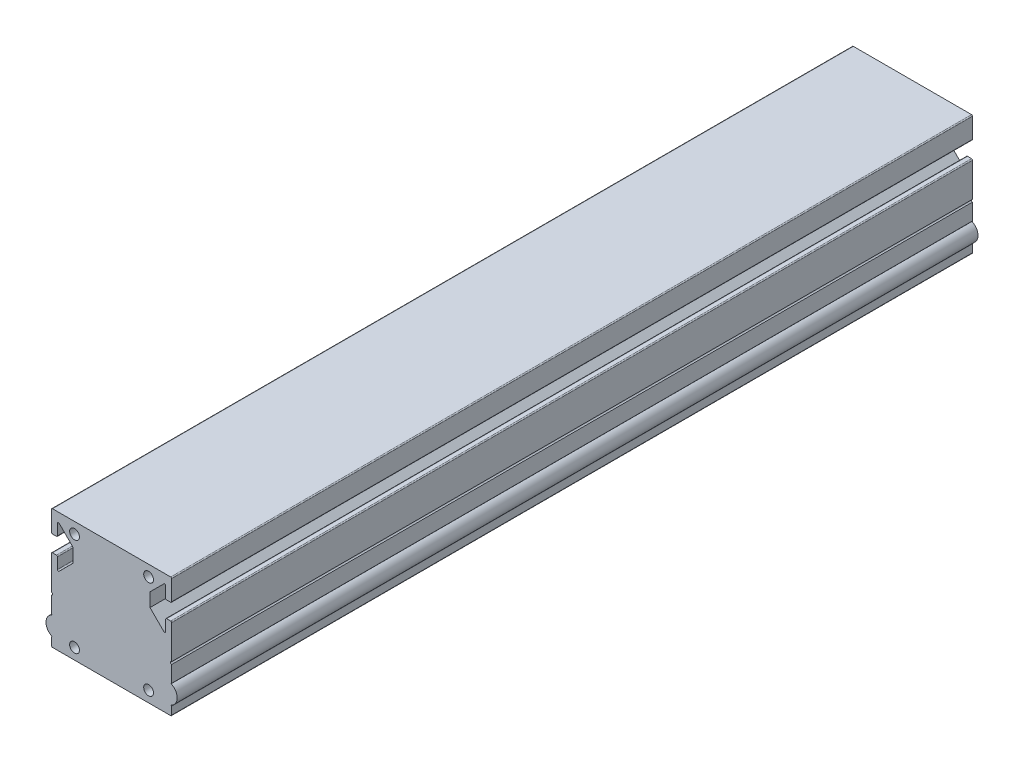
ISO-10303-21;
HEADER;
FILE_DESCRIPTION(('STEP AP214'),'2;1');
FILE_NAME('part.step','',(''),(''),'','','');
FILE_SCHEMA(('AUTOMOTIVE_DESIGN { 1 0 10303 214 1 1 1 1 }'));
ENDSEC;
DATA;
#1=APPLICATION_CONTEXT('core data for automotive mechanical design processes');
#2=APPLICATION_PROTOCOL_DEFINITION('international standard','automotive_design',2000,#1);
#3=PRODUCT_CONTEXT('',#1,'mechanical');
#4=PRODUCT('Part','Part','',(#3));
#5=PRODUCT_RELATED_PRODUCT_CATEGORY('part','',(#4));
#6=PRODUCT_DEFINITION_FORMATION('','',#4);
#7=PRODUCT_DEFINITION_CONTEXT('part definition',#1,'design');
#8=PRODUCT_DEFINITION('design','',#6,#7);
#9=PRODUCT_DEFINITION_SHAPE('','',#8);
#10=(LENGTH_UNIT() NAMED_UNIT(*) SI_UNIT(.MILLI.,.METRE.));
#11=(NAMED_UNIT(*) PLANE_ANGLE_UNIT() SI_UNIT($,.RADIAN.));
#12=(NAMED_UNIT(*) SI_UNIT($,.STERADIAN.) SOLID_ANGLE_UNIT());
#13=UNCERTAINTY_MEASURE_WITH_UNIT(LENGTH_MEASURE(1.E-05),#10,'distance_accuracy_value','');
#14=(GEOMETRIC_REPRESENTATION_CONTEXT(3) GLOBAL_UNCERTAINTY_ASSIGNED_CONTEXT((#13)) GLOBAL_UNIT_ASSIGNED_CONTEXT((#10,
#11,#12)) REPRESENTATION_CONTEXT('',''));
#15=CARTESIAN_POINT('',(0.,0.,0.));
#16=DIRECTION('',(0.,0.,1.));
#17=DIRECTION('',(1.,0.,0.));
#18=AXIS2_PLACEMENT_3D('',#15,#16,#17);
#19=CARTESIAN_POINT('',(-30.,30.,400.));
#20=DIRECTION('',(1.,0.,0.));
#21=DIRECTION('',(0.,1.,0.));
#22=AXIS2_PLACEMENT_3D('',#19,#20,#21);
#23=PLANE('',#22);
#24=DIRECTION('',(0.,-1.,0.));
#25=VECTOR('',#24,1.);
#26=CARTESIAN_POINT('',(-30.,30.,400.));
#27=LINE('',#26,#25);
#28=CARTESIAN_POINT('',(-30.,10.45,400.));
#29=VERTEX_POINT('',#28);
#30=CARTESIAN_POINT('',(-30.,-6.4,400.));
#31=VERTEX_POINT('',#30);
#32=EDGE_CURVE('E526',#29,#31,#27,.T.);
#33=ORIENTED_EDGE('',*,*,#32,.F.);
#34=DIRECTION('',(0.,0.,-1.));
#35=VECTOR('',#34,1.);
#36=CARTESIAN_POINT('',(-30.,10.45,400.));
#37=LINE('',#36,#35);
#38=CARTESIAN_POINT('',(-30.,10.45,0.));
#39=VERTEX_POINT('',#38);
#40=EDGE_CURVE('E610',#29,#39,#37,.T.);
#41=ORIENTED_EDGE('',*,*,#40,.T.);
#42=DIRECTION('',(0.,-1.,0.));
#43=VECTOR('',#42,1.);
#44=CARTESIAN_POINT('',(-30.,30.,0.));
#45=LINE('',#44,#43);
#46=CARTESIAN_POINT('',(-30.,-6.4,0.));
#47=VERTEX_POINT('',#46);
#48=EDGE_CURVE('E539',#39,#47,#45,.T.);
#49=ORIENTED_EDGE('',*,*,#48,.T.);
#50=DIRECTION('',(0.,0.,-1.));
#51=VECTOR('',#50,1.);
#52=CARTESIAN_POINT('',(-30.,-6.4,400.));
#53=LINE('',#52,#51);
#54=EDGE_CURVE('E448',#31,#47,#53,.T.);
#55=ORIENTED_EDGE('',*,*,#54,.F.);
#56=EDGE_LOOP('',(#33,#41,#49,#55));
#57=FACE_BOUND('',#56,.T.);
#58=ADVANCED_FACE('F32',(#57),#23,.F.);
#59=CARTESIAN_POINT('',(-30.,-25.6621064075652,400.));
#60=VERTEX_POINT('',#59);
#61=CARTESIAN_POINT('',(-30.,-29.5,400.));
#62=VERTEX_POINT('',#61);
#63=EDGE_CURVE('E520',#60,#62,#27,.T.);
#64=ORIENTED_EDGE('',*,*,#63,.F.);
#65=DIRECTION('',(0.,0.,-1.));
#66=VECTOR('',#65,1.);
#67=CARTESIAN_POINT('',(-30.,-25.6621064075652,400.));
#68=LINE('',#67,#66);
#69=CARTESIAN_POINT('',(-30.,-25.6621064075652,0.));
#70=VERTEX_POINT('',#69);
#71=EDGE_CURVE('E348',#60,#70,#68,.T.);
#72=ORIENTED_EDGE('',*,*,#71,.T.);
#73=CARTESIAN_POINT('',(-30.,-29.5,0.));
#74=VERTEX_POINT('',#73);
#75=EDGE_CURVE('E538',#70,#74,#45,.T.);
#76=ORIENTED_EDGE('',*,*,#75,.T.);
#77=DIRECTION('',(0.,0.,-1.));
#78=VECTOR('',#77,1.);
#79=CARTESIAN_POINT('',(-30.,-29.5,400.));
#80=LINE('',#79,#78);
#81=EDGE_CURVE('E571',#74,#62,#80,.F.);
#82=ORIENTED_EDGE('',*,*,#81,.T.);
#83=EDGE_LOOP('',(#64,#72,#76,#82));
#84=FACE_BOUND('',#83,.T.);
#85=ADVANCED_FACE('F809',(#84),#23,.F.);
#86=CARTESIAN_POINT('',(-30.,-7.6,0.));
#87=VERTEX_POINT('',#86);
#88=CARTESIAN_POINT('',(-30.,-15.7378935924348,0.));
#89=VERTEX_POINT('',#88);
#90=EDGE_CURVE('E541',#87,#89,#45,.T.);
#91=ORIENTED_EDGE('',*,*,#90,.T.);
#92=DIRECTION('',(0.,0.,-1.));
#93=VECTOR('',#92,1.);
#94=CARTESIAN_POINT('',(-30.,-15.7378935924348,400.));
#95=LINE('',#94,#93);
#96=CARTESIAN_POINT('',(-30.,-15.7378935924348,400.));
#97=VERTEX_POINT('',#96);
#98=EDGE_CURVE('E47',#89,#97,#95,.F.);
#99=ORIENTED_EDGE('',*,*,#98,.T.);
#100=CARTESIAN_POINT('',(-30.,-7.6,400.));
#101=VERTEX_POINT('',#100);
#102=EDGE_CURVE('E527',#101,#97,#27,.T.);
#103=ORIENTED_EDGE('',*,*,#102,.F.);
#104=DIRECTION('',(0.,0.,-1.));
#105=VECTOR('',#104,1.);
#106=CARTESIAN_POINT('',(-30.,-7.6,400.));
#107=LINE('',#106,#105);
#108=EDGE_CURVE('E444',#101,#87,#107,.T.);
#109=ORIENTED_EDGE('',*,*,#108,.T.);
#110=EDGE_LOOP('',(#91,#99,#103,#109));
#111=FACE_BOUND('',#110,.T.);
#112=ADVANCED_FACE('F816',(#111),#23,.F.);
#113=CARTESIAN_POINT('',(30.,-30.,400.));
#114=DIRECTION('',(0.,0.,-1.));
#115=DIRECTION('',(-1.,0.,0.));
#116=AXIS2_PLACEMENT_3D('',#113,#114,#115);
#117=PLANE('',#116);
#118=CARTESIAN_POINT('',(18.5,24.5,400.));
#119=DIRECTION('',(0.,0.,-1.));
#120=DIRECTION('',(-1.,0.,0.));
#121=AXIS2_PLACEMENT_3D('',#118,#119,#120);
#122=CIRCLE('',#121,2.4499999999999);
#123=CARTESIAN_POINT('',(16.0500000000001,24.5,400.));
#124=VERTEX_POINT('',#123);
#125=EDGE_CURVE('E371',#124,#124,#122,.T.);
#126=ORIENTED_EDGE('',*,*,#125,.T.);
#127=EDGE_LOOP('',(#126));
#128=FACE_BOUND('',#127,.T.);
#129=CARTESIAN_POINT('',(-18.5,24.5,400.));
#130=DIRECTION('',(0.,0.,-1.));
#131=DIRECTION('',(-1.,0.,0.));
#132=AXIS2_PLACEMENT_3D('',#129,#130,#131);
#133=CIRCLE('',#132,2.4499999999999);
#134=CARTESIAN_POINT('',(-20.9499999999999,24.5,400.));
#135=VERTEX_POINT('',#134);
#136=EDGE_CURVE('E377',#135,#135,#133,.T.);
#137=ORIENTED_EDGE('',*,*,#136,.T.);
#138=EDGE_LOOP('',(#137));
#139=FACE_BOUND('',#138,.T.);
#140=CARTESIAN_POINT('',(18.5,-24.5,400.));
#141=DIRECTION('',(0.,0.,-1.));
#142=DIRECTION('',(-1.,0.,0.));
#143=AXIS2_PLACEMENT_3D('',#140,#141,#142);
#144=CIRCLE('',#143,2.4499999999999);
#145=CARTESIAN_POINT('',(16.0500000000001,-24.5,400.));
#146=VERTEX_POINT('',#145);
#147=EDGE_CURVE('E383',#146,#146,#144,.T.);
#148=ORIENTED_EDGE('',*,*,#147,.T.);
#149=EDGE_LOOP('',(#148));
#150=FACE_BOUND('',#149,.T.);
#151=CARTESIAN_POINT('',(-18.5,-24.5,400.));
#152=DIRECTION('',(0.,0.,-1.));
#153=DIRECTION('',(-1.,0.,0.));
#154=AXIS2_PLACEMENT_3D('',#151,#152,#153);
#155=CIRCLE('',#154,2.4499999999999);
#156=CARTESIAN_POINT('',(-20.9499999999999,-24.5,400.));
#157=VERTEX_POINT('',#156);
#158=EDGE_CURVE('E389',#157,#157,#155,.T.);
#159=ORIENTED_EDGE('',*,*,#158,.T.);
#160=EDGE_LOOP('',(#159));
#161=FACE_BOUND('',#160,.T.);
#162=CARTESIAN_POINT('',(-29.7,-15.7378935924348,400.));
#163=DIRECTION('',(0.,0.,-1.));
#164=DIRECTION('',(-1.,0.,0.));
#165=AXIS2_PLACEMENT_3D('',#162,#163,#164);
#166=CIRCLE('',#165,0.3);
#167=CARTESIAN_POINT('',(-29.5878504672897,-16.0161425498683,400.));
#168=VERTEX_POINT('',#167);
#169=EDGE_CURVE('E703',#97,#168,#166,.F.);
#170=ORIENTED_EDGE('',*,*,#169,.T.);
#171=CARTESIAN_POINT('',(-27.7,-20.7,400.));
#172=DIRECTION('',(0.,0.,1.));
#173=DIRECTION('',(1.,0.,0.));
#174=AXIS2_PLACEMENT_3D('',#171,#172,#173);
#175=CIRCLE('',#174,5.05);
#176=CARTESIAN_POINT('',(-29.5878504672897,-25.3838574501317,400.));
#177=VERTEX_POINT('',#176);
#178=EDGE_CURVE('E362',#168,#177,#175,.T.);
#179=ORIENTED_EDGE('',*,*,#178,.T.);
#180=CARTESIAN_POINT('',(-29.7,-25.6621064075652,400.));
#181=DIRECTION('',(0.,0.,-1.));
#182=DIRECTION('',(-1.,0.,0.));
#183=AXIS2_PLACEMENT_3D('',#180,#181,#182);
#184=CIRCLE('',#183,0.3);
#185=EDGE_CURVE('E705',#177,#60,#184,.F.);
#186=ORIENTED_EDGE('',*,*,#185,.T.);
#187=ORIENTED_EDGE('',*,*,#63,.T.);
#188=CARTESIAN_POINT('',(-29.5,-29.5,400.));
#189=DIRECTION('',(0.,0.,-1.));
#190=DIRECTION('',(-1.,0.,0.));
#191=AXIS2_PLACEMENT_3D('',#188,#189,#190);
#192=CIRCLE('',#191,0.5);
#193=CARTESIAN_POINT('',(-29.5,-30.,400.));
#194=VERTEX_POINT('',#193);
#195=EDGE_CURVE('E596',#62,#194,#192,.F.);
#196=ORIENTED_EDGE('',*,*,#195,.T.);
#197=DIRECTION('',(1.,0.,0.));
#198=VECTOR('',#197,1.);
#199=CARTESIAN_POINT('',(30.,-30.,400.));
#200=LINE('',#199,#198);
#201=CARTESIAN_POINT('',(29.5,-30.,400.));
#202=VERTEX_POINT('',#201);
#203=EDGE_CURVE('E508',#194,#202,#200,.T.);
#204=ORIENTED_EDGE('',*,*,#203,.T.);
#205=CARTESIAN_POINT('',(29.5,-29.5,400.));
#206=DIRECTION('',(0.,0.,-1.));
#207=DIRECTION('',(-1.,0.,0.));
#208=AXIS2_PLACEMENT_3D('',#205,#206,#207);
#209=CIRCLE('',#208,0.5);
#210=CARTESIAN_POINT('',(30.,-29.5,400.));
#211=VERTEX_POINT('',#210);
#212=EDGE_CURVE('E584',#202,#211,#209,.F.);
#213=ORIENTED_EDGE('',*,*,#212,.T.);
#214=DIRECTION('',(0.,1.,0.));
#215=VECTOR('',#214,1.);
#216=CARTESIAN_POINT('',(30.,-30.,400.));
#217=LINE('',#216,#215);
#218=CARTESIAN_POINT('',(30.,-25.6621064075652,400.));
#219=VERTEX_POINT('',#218);
#220=EDGE_CURVE('E521',#211,#219,#217,.T.);
#221=ORIENTED_EDGE('',*,*,#220,.T.);
#222=CARTESIAN_POINT('',(29.7,-25.6621064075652,400.));
#223=DIRECTION('',(0.,0.,-1.));
#224=DIRECTION('',(-1.,0.,0.));
#225=AXIS2_PLACEMENT_3D('',#222,#223,#224);
#226=CIRCLE('',#225,0.3);
#227=CARTESIAN_POINT('',(29.5878504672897,-25.3838574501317,400.));
#228=VERTEX_POINT('',#227);
#229=EDGE_CURVE('E700',#219,#228,#226,.F.);
#230=ORIENTED_EDGE('',*,*,#229,.T.);
#231=CARTESIAN_POINT('',(27.7,-20.7,400.));
#232=DIRECTION('',(0.,0.,1.));
#233=DIRECTION('',(1.,0.,0.));
#234=AXIS2_PLACEMENT_3D('',#231,#232,#233);
#235=CIRCLE('',#234,5.05);
#236=CARTESIAN_POINT('',(29.5878504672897,-16.0161425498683,400.));
#237=VERTEX_POINT('',#236);
#238=EDGE_CURVE('E355',#228,#237,#235,.T.);
#239=ORIENTED_EDGE('',*,*,#238,.T.);
#240=CARTESIAN_POINT('',(29.7,-15.7378935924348,400.));
#241=DIRECTION('',(0.,0.,-1.));
#242=DIRECTION('',(-1.,0.,0.));
#243=AXIS2_PLACEMENT_3D('',#240,#241,#242);
#244=CIRCLE('',#243,0.3);
#245=CARTESIAN_POINT('',(30.,-15.7378935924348,400.));
#246=VERTEX_POINT('',#245);
#247=EDGE_CURVE('E55',#237,#246,#244,.F.);
#248=ORIENTED_EDGE('',*,*,#247,.T.);
#249=CARTESIAN_POINT('',(30.,-7.6,400.));
#250=VERTEX_POINT('',#249);
#251=EDGE_CURVE('E516',#246,#250,#217,.T.);
#252=ORIENTED_EDGE('',*,*,#251,.T.);
#253=CARTESIAN_POINT('',(30.,-7.,400.));
#254=DIRECTION('',(0.,0.,1.));
#255=DIRECTION('',(1.,0.,0.));
#256=AXIS2_PLACEMENT_3D('',#253,#254,#255);
#257=CIRCLE('',#256,0.6);
#258=CARTESIAN_POINT('',(30.,-6.4,400.));
#259=VERTEX_POINT('',#258);
#260=EDGE_CURVE('E496',#259,#250,#257,.T.);
#261=ORIENTED_EDGE('',*,*,#260,.F.);
#262=CARTESIAN_POINT('',(30.,10.45,400.));
#263=VERTEX_POINT('',#262);
#264=EDGE_CURVE('E515',#259,#263,#217,.T.);
#265=ORIENTED_EDGE('',*,*,#264,.T.);
#266=CARTESIAN_POINT('',(29.5,10.45,400.));
#267=DIRECTION('',(0.,0.,-1.));
#268=DIRECTION('',(-1.,0.,0.));
#269=AXIS2_PLACEMENT_3D('',#266,#267,#268);
#270=CIRCLE('',#269,0.5);
#271=CARTESIAN_POINT('',(29.5,10.95,400.));
#272=VERTEX_POINT('',#271);
#273=EDGE_CURVE('E578',#263,#272,#270,.F.);
#274=ORIENTED_EDGE('',*,*,#273,.T.);
#275=DIRECTION('',(1.,0.,0.));
#276=VECTOR('',#275,1.);
#277=CARTESIAN_POINT('',(30.,10.95,400.));
#278=LINE('',#277,#276);
#279=CARTESIAN_POINT('',(27.5,10.95,400.));
#280=VERTEX_POINT('',#279);
#281=EDGE_CURVE('E452',#280,#272,#278,.T.);
#282=ORIENTED_EDGE('',*,*,#281,.F.);
#283=CARTESIAN_POINT('',(27.5,10.45,400.));
#284=DIRECTION('',(0.,0.,-1.));
#285=DIRECTION('',(-1.,0.,0.));
#286=AXIS2_PLACEMENT_3D('',#283,#284,#285);
#287=CIRCLE('',#286,0.5);
#288=CARTESIAN_POINT('',(27.,10.45,400.));
#289=VERTEX_POINT('',#288);
#290=EDGE_CURVE('E576',#280,#289,#287,.F.);
#291=ORIENTED_EDGE('',*,*,#290,.T.);
#292=DIRECTION('',(0.,1.,0.));
#293=VECTOR('',#292,1.);
#294=CARTESIAN_POINT('',(27.,10.95,400.));
#295=LINE('',#294,#293);
#296=CARTESIAN_POINT('',(27.,5.00000000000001,400.));
#297=VERTEX_POINT('',#296);
#298=EDGE_CURVE('E469',#297,#289,#295,.T.);
#299=ORIENTED_EDGE('',*,*,#298,.F.);
#300=CARTESIAN_POINT('',(26.5,5.00000000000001,400.));
#301=DIRECTION('',(0.,0.,-1.));
#302=DIRECTION('',(-1.,0.,0.));
#303=AXIS2_PLACEMENT_3D('',#300,#301,#302);
#304=CIRCLE('',#303,0.5);
#305=CARTESIAN_POINT('',(26.1464466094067,4.64644660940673,400.));
#306=VERTEX_POINT('',#305);
#307=EDGE_CURVE('E681',#297,#306,#304,.T.);
#308=ORIENTED_EDGE('',*,*,#307,.T.);
#309=DIRECTION('',(0.707106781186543,-0.707106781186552,0.));
#310=VECTOR('',#309,1.);
#311=CARTESIAN_POINT('',(27.,3.79289321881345,400.));
#312=LINE('',#311,#310);
#313=CARTESIAN_POINT('',(19.2,11.5928932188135,400.));
#314=VERTEX_POINT('',#313);
#315=EDGE_CURVE('E466',#314,#306,#312,.T.);
#316=ORIENTED_EDGE('',*,*,#315,.F.);
#317=DIRECTION('',(0.,-1.,0.));
#318=VECTOR('',#317,1.);
#319=CARTESIAN_POINT('',(19.2,11.5928932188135,400.));
#320=LINE('',#319,#318);
#321=CARTESIAN_POINT('',(19.2,18.4071067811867,400.));
#322=VERTEX_POINT('',#321);
#323=EDGE_CURVE('E464',#322,#314,#320,.T.);
#324=ORIENTED_EDGE('',*,*,#323,.F.);
#325=DIRECTION('',(-0.707106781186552,-0.707106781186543,0.));
#326=VECTOR('',#325,1.);
#327=CARTESIAN_POINT('',(19.2,18.4071067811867,400.));
#328=LINE('',#327,#326);
#329=CARTESIAN_POINT('',(26.1464466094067,25.3535533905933,400.));
#330=VERTEX_POINT('',#329);
#331=EDGE_CURVE('E462',#330,#322,#328,.T.);
#332=ORIENTED_EDGE('',*,*,#331,.F.);
#333=CARTESIAN_POINT('',(26.5,25.,400.));
#334=DIRECTION('',(0.,0.,-1.));
#335=DIRECTION('',(-1.,0.,0.));
#336=AXIS2_PLACEMENT_3D('',#333,#334,#335);
#337=CIRCLE('',#336,0.5);
#338=CARTESIAN_POINT('',(27.,25.,400.));
#339=VERTEX_POINT('',#338);
#340=EDGE_CURVE('E685',#330,#339,#337,.T.);
#341=ORIENTED_EDGE('',*,*,#340,.T.);
#342=DIRECTION('',(0.,1.,0.));
#343=VECTOR('',#342,1.);
#344=CARTESIAN_POINT('',(27.,26.2071067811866,400.));
#345=LINE('',#344,#343);
#346=CARTESIAN_POINT('',(27.,19.55,400.));
#347=VERTEX_POINT('',#346);
#348=EDGE_CURVE('E459',#347,#339,#345,.T.);
#349=ORIENTED_EDGE('',*,*,#348,.F.);
#350=CARTESIAN_POINT('',(27.5,19.55,400.));
#351=DIRECTION('',(0.,0.,-1.));
#352=DIRECTION('',(-1.,0.,0.));
#353=AXIS2_PLACEMENT_3D('',#350,#351,#352);
#354=CIRCLE('',#353,0.5);
#355=CARTESIAN_POINT('',(27.5,19.05,400.));
#356=VERTEX_POINT('',#355);
#357=EDGE_CURVE('E574',#347,#356,#354,.F.);
#358=ORIENTED_EDGE('',*,*,#357,.T.);
#359=DIRECTION('',(-1.,0.,0.));
#360=VECTOR('',#359,1.);
#361=CARTESIAN_POINT('',(27.,19.05,400.));
#362=LINE('',#361,#360);
#363=CARTESIAN_POINT('',(29.5,19.05,400.));
#364=VERTEX_POINT('',#363);
#365=EDGE_CURVE('E455',#364,#356,#362,.T.);
#366=ORIENTED_EDGE('',*,*,#365,.F.);
#367=CARTESIAN_POINT('',(29.5,19.55,400.));
#368=DIRECTION('',(0.,0.,-1.));
#369=DIRECTION('',(-1.,0.,0.));
#370=AXIS2_PLACEMENT_3D('',#367,#368,#369);
#371=CIRCLE('',#370,0.5);
#372=CARTESIAN_POINT('',(30.,19.55,400.));
#373=VERTEX_POINT('',#372);
#374=EDGE_CURVE('E580',#364,#373,#371,.F.);
#375=ORIENTED_EDGE('',*,*,#374,.T.);
#376=CARTESIAN_POINT('',(30.,29.5,400.));
#377=VERTEX_POINT('',#376);
#378=EDGE_CURVE('E511',#373,#377,#217,.T.);
#379=ORIENTED_EDGE('',*,*,#378,.T.);
#380=CARTESIAN_POINT('',(29.5,29.5,400.));
#381=DIRECTION('',(0.,0.,-1.));
#382=DIRECTION('',(-1.,0.,0.));
#383=AXIS2_PLACEMENT_3D('',#380,#381,#382);
#384=CIRCLE('',#383,0.5);
#385=CARTESIAN_POINT('',(29.5,30.,400.));
#386=VERTEX_POINT('',#385);
#387=EDGE_CURVE('E582',#377,#386,#384,.F.);
#388=ORIENTED_EDGE('',*,*,#387,.T.);
#389=DIRECTION('',(-1.,0.,0.));
#390=VECTOR('',#389,1.);
#391=CARTESIAN_POINT('',(30.,30.,400.));
#392=LINE('',#391,#390);
#393=CARTESIAN_POINT('',(-29.5,30.,400.));
#394=VERTEX_POINT('',#393);
#395=EDGE_CURVE('E517',#386,#394,#392,.T.);
#396=ORIENTED_EDGE('',*,*,#395,.T.);
#397=CARTESIAN_POINT('',(-29.5,29.5,400.));
#398=DIRECTION('',(0.,0.,-1.));
#399=DIRECTION('',(-1.,0.,0.));
#400=AXIS2_PLACEMENT_3D('',#397,#398,#399);
#401=CIRCLE('',#400,0.5);
#402=CARTESIAN_POINT('',(-30.,29.5,400.));
#403=VERTEX_POINT('',#402);
#404=EDGE_CURVE('E590',#394,#403,#401,.F.);
#405=ORIENTED_EDGE('',*,*,#404,.T.);
#406=CARTESIAN_POINT('',(-30.,19.55,400.));
#407=VERTEX_POINT('',#406);
#408=EDGE_CURVE('E522',#403,#407,#27,.T.);
#409=ORIENTED_EDGE('',*,*,#408,.T.);
#410=CARTESIAN_POINT('',(-29.5,19.55,400.));
#411=DIRECTION('',(0.,0.,-1.));
#412=DIRECTION('',(-1.,0.,0.));
#413=AXIS2_PLACEMENT_3D('',#410,#411,#412);
#414=CIRCLE('',#413,0.5);
#415=CARTESIAN_POINT('',(-29.5,19.05,400.));
#416=VERTEX_POINT('',#415);
#417=EDGE_CURVE('E588',#407,#416,#414,.F.);
#418=ORIENTED_EDGE('',*,*,#417,.T.);
#419=DIRECTION('',(1.,0.,0.));
#420=VECTOR('',#419,1.);
#421=CARTESIAN_POINT('',(-27.,19.05,400.));
#422=LINE('',#421,#420);
#423=CARTESIAN_POINT('',(-27.5,19.05,400.));
#424=VERTEX_POINT('',#423);
#425=EDGE_CURVE('E414',#416,#424,#422,.T.);
#426=ORIENTED_EDGE('',*,*,#425,.T.);
#427=CARTESIAN_POINT('',(-27.5,19.55,400.));
#428=DIRECTION('',(0.,0.,-1.));
#429=DIRECTION('',(-1.,0.,0.));
#430=AXIS2_PLACEMENT_3D('',#427,#428,#429);
#431=CIRCLE('',#430,0.5);
#432=CARTESIAN_POINT('',(-27.,19.55,400.));
#433=VERTEX_POINT('',#432);
#434=EDGE_CURVE('E586',#424,#433,#431,.F.);
#435=ORIENTED_EDGE('',*,*,#434,.T.);
#436=DIRECTION('',(0.,1.,0.));
#437=VECTOR('',#436,1.);
#438=CARTESIAN_POINT('',(-27.,26.2071067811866,400.));
#439=LINE('',#438,#437);
#440=CARTESIAN_POINT('',(-27.,25.,400.));
#441=VERTEX_POINT('',#440);
#442=EDGE_CURVE('E411',#433,#441,#439,.T.);
#443=ORIENTED_EDGE('',*,*,#442,.T.);
#444=CARTESIAN_POINT('',(-26.5,25.,400.));
#445=DIRECTION('',(0.,0.,-1.));
#446=DIRECTION('',(-1.,0.,0.));
#447=AXIS2_PLACEMENT_3D('',#444,#445,#446);
#448=CIRCLE('',#447,0.5);
#449=CARTESIAN_POINT('',(-26.1464466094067,25.3535533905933,400.));
#450=VERTEX_POINT('',#449);
#451=EDGE_CURVE('E677',#441,#450,#448,.T.);
#452=ORIENTED_EDGE('',*,*,#451,.T.);
#453=DIRECTION('',(0.707106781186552,-0.707106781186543,0.));
#454=VECTOR('',#453,1.);
#455=CARTESIAN_POINT('',(-19.2,18.4071067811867,400.));
#456=LINE('',#455,#454);
#457=CARTESIAN_POINT('',(-19.2,18.4071067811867,400.));
#458=VERTEX_POINT('',#457);
#459=EDGE_CURVE('E409',#450,#458,#456,.T.);
#460=ORIENTED_EDGE('',*,*,#459,.T.);
#461=DIRECTION('',(0.,-1.,0.));
#462=VECTOR('',#461,1.);
#463=CARTESIAN_POINT('',(-19.2,11.5928932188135,400.));
#464=LINE('',#463,#462);
#465=CARTESIAN_POINT('',(-19.2,11.5928932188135,400.));
#466=VERTEX_POINT('',#465);
#467=EDGE_CURVE('E406',#458,#466,#464,.T.);
#468=ORIENTED_EDGE('',*,*,#467,.T.);
#469=DIRECTION('',(-0.707106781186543,-0.707106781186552,0.));
#470=VECTOR('',#469,1.);
#471=CARTESIAN_POINT('',(-27.,3.79289321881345,400.));
#472=LINE('',#471,#470);
#473=CARTESIAN_POINT('',(-26.1464466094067,4.64644660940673,400.));
#474=VERTEX_POINT('',#473);
#475=EDGE_CURVE('E403',#466,#474,#472,.T.);
#476=ORIENTED_EDGE('',*,*,#475,.T.);
#477=CARTESIAN_POINT('',(-26.5,5.00000000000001,400.));
#478=DIRECTION('',(0.,0.,-1.));
#479=DIRECTION('',(-1.,0.,0.));
#480=AXIS2_PLACEMENT_3D('',#477,#478,#479);
#481=CIRCLE('',#480,0.5);
#482=CARTESIAN_POINT('',(-27.,5.00000000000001,400.));
#483=VERTEX_POINT('',#482);
#484=EDGE_CURVE('E673',#474,#483,#481,.T.);
#485=ORIENTED_EDGE('',*,*,#484,.T.);
#486=DIRECTION('',(0.,1.,0.));
#487=VECTOR('',#486,1.);
#488=CARTESIAN_POINT('',(-27.,10.95,400.));
#489=LINE('',#488,#487);
#490=CARTESIAN_POINT('',(-27.,10.45,400.));
#491=VERTEX_POINT('',#490);
#492=EDGE_CURVE('E399',#483,#491,#489,.T.);
#493=ORIENTED_EDGE('',*,*,#492,.T.);
#494=CARTESIAN_POINT('',(-27.5,10.45,400.));
#495=DIRECTION('',(0.,0.,-1.));
#496=DIRECTION('',(-1.,0.,0.));
#497=AXIS2_PLACEMENT_3D('',#494,#495,#496);
#498=CIRCLE('',#497,0.5);
#499=CARTESIAN_POINT('',(-27.5,10.95,400.));
#500=VERTEX_POINT('',#499);
#501=EDGE_CURVE('E594',#491,#500,#498,.F.);
#502=ORIENTED_EDGE('',*,*,#501,.T.);
#503=DIRECTION('',(-1.,0.,0.));
#504=VECTOR('',#503,1.);
#505=CARTESIAN_POINT('',(-30.,10.95,400.));
#506=LINE('',#505,#504);
#507=CARTESIAN_POINT('',(-29.5,10.95,400.));
#508=VERTEX_POINT('',#507);
#509=EDGE_CURVE('E396',#500,#508,#506,.T.);
#510=ORIENTED_EDGE('',*,*,#509,.T.);
#511=CARTESIAN_POINT('',(-29.5,10.45,400.));
#512=DIRECTION('',(0.,0.,-1.));
#513=DIRECTION('',(-1.,0.,0.));
#514=AXIS2_PLACEMENT_3D('',#511,#512,#513);
#515=CIRCLE('',#514,0.5);
#516=EDGE_CURVE('E592',#508,#29,#515,.F.);
#517=ORIENTED_EDGE('',*,*,#516,.T.);
#518=ORIENTED_EDGE('',*,*,#32,.T.);
#519=CARTESIAN_POINT('',(-30.,-7.,400.));
#520=DIRECTION('',(0.,0.,-1.));
#521=DIRECTION('',(-1.,0.,0.));
#522=AXIS2_PLACEMENT_3D('',#519,#520,#521);
#523=CIRCLE('',#522,0.6);
#524=EDGE_CURVE('E441',#31,#101,#523,.T.);
#525=ORIENTED_EDGE('',*,*,#524,.T.);
#526=ORIENTED_EDGE('',*,*,#102,.T.);
#527=EDGE_LOOP('',(#170,#179,#186,#187,#196,#204,#213,#221,#230,#239,#248,#252,#261,#265,#274,
#282,#291,#299,#308,#316,#324,#332,#341,#349,#358,#366,#375,#379,#388,#396,#405,#409,#418,#426,
#435,#443,#452,#460,#468,#476,#485,#493,#502,#510,#517,#518,#525,#526));
#528=FACE_BOUND('',#527,.T.);
#529=ADVANCED_FACE('F710',(#128,#139,#150,#161,#528),#117,.F.);
#530=CARTESIAN_POINT('',(30.,-30.,0.));
#531=DIRECTION('',(0.,0.,-1.));
#532=DIRECTION('',(-1.,0.,0.));
#533=AXIS2_PLACEMENT_3D('',#530,#531,#532);
#534=PLANE('',#533);
#535=CARTESIAN_POINT('',(18.5,24.5,0.));
#536=DIRECTION('',(0.,0.,-1.));
#537=DIRECTION('',(-1.,0.,0.));
#538=AXIS2_PLACEMENT_3D('',#535,#536,#537);
#539=CIRCLE('',#538,2.44999999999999);
#540=CARTESIAN_POINT('',(16.05,24.5,0.));
#541=VERTEX_POINT('',#540);
#542=EDGE_CURVE('E374',#541,#541,#539,.T.);
#543=ORIENTED_EDGE('',*,*,#542,.F.);
#544=EDGE_LOOP('',(#543));
#545=FACE_BOUND('',#544,.T.);
#546=CARTESIAN_POINT('',(-18.5,24.5,0.));
#547=DIRECTION('',(0.,0.,-1.));
#548=DIRECTION('',(-1.,0.,0.));
#549=AXIS2_PLACEMENT_3D('',#546,#547,#548);
#550=CIRCLE('',#549,2.44999999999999);
#551=CARTESIAN_POINT('',(-20.95,24.5,0.));
#552=VERTEX_POINT('',#551);
#553=EDGE_CURVE('E380',#552,#552,#550,.T.);
#554=ORIENTED_EDGE('',*,*,#553,.F.);
#555=EDGE_LOOP('',(#554));
#556=FACE_BOUND('',#555,.T.);
#557=CARTESIAN_POINT('',(18.5,-24.5,0.));
#558=DIRECTION('',(0.,0.,-1.));
#559=DIRECTION('',(-1.,0.,0.));
#560=AXIS2_PLACEMENT_3D('',#557,#558,#559);
#561=CIRCLE('',#560,2.44999999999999);
#562=CARTESIAN_POINT('',(16.05,-24.5,0.));
#563=VERTEX_POINT('',#562);
#564=EDGE_CURVE('E386',#563,#563,#561,.T.);
#565=ORIENTED_EDGE('',*,*,#564,.F.);
#566=EDGE_LOOP('',(#565));
#567=FACE_BOUND('',#566,.T.);
#568=CARTESIAN_POINT('',(-18.5,-24.5,0.));
#569=DIRECTION('',(0.,0.,-1.));
#570=DIRECTION('',(-1.,0.,0.));
#571=AXIS2_PLACEMENT_3D('',#568,#569,#570);
#572=CIRCLE('',#571,2.44999999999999);
#573=CARTESIAN_POINT('',(-20.95,-24.5,0.));
#574=VERTEX_POINT('',#573);
#575=EDGE_CURVE('E392',#574,#574,#572,.T.);
#576=ORIENTED_EDGE('',*,*,#575,.F.);
#577=EDGE_LOOP('',(#576));
#578=FACE_BOUND('',#577,.T.);
#579=ORIENTED_EDGE('',*,*,#75,.F.);
#580=CARTESIAN_POINT('',(-29.7,-25.6621064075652,0.));
#581=DIRECTION('',(0.,0.,-1.));
#582=DIRECTION('',(-1.,0.,0.));
#583=AXIS2_PLACEMENT_3D('',#580,#581,#582);
#584=CIRCLE('',#583,0.3);
#585=CARTESIAN_POINT('',(-29.5878504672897,-25.3838574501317,0.));
#586=VERTEX_POINT('',#585);
#587=EDGE_CURVE('E692',#70,#586,#584,.T.);
#588=ORIENTED_EDGE('',*,*,#587,.T.);
#589=CARTESIAN_POINT('',(-27.7,-20.7,0.));
#590=DIRECTION('',(0.,0.,-1.));
#591=DIRECTION('',(-1.,0.,0.));
#592=AXIS2_PLACEMENT_3D('',#589,#590,#591);
#593=CIRCLE('',#592,5.05);
#594=CARTESIAN_POINT('',(-29.5878504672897,-16.0161425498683,0.));
#595=VERTEX_POINT('',#594);
#596=EDGE_CURVE('E365',#595,#586,#593,.F.);
#597=ORIENTED_EDGE('',*,*,#596,.F.);
#598=CARTESIAN_POINT('',(-29.7,-15.7378935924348,0.));
#599=DIRECTION('',(0.,0.,-1.));
#600=DIRECTION('',(-1.,0.,0.));
#601=AXIS2_PLACEMENT_3D('',#598,#599,#600);
#602=CIRCLE('',#601,0.3);
#603=EDGE_CURVE('E690',#595,#89,#602,.T.);
#604=ORIENTED_EDGE('',*,*,#603,.T.);
#605=ORIENTED_EDGE('',*,*,#90,.F.);
#606=CARTESIAN_POINT('',(-30.,-7.,0.));
#607=DIRECTION('',(0.,0.,-1.));
#608=DIRECTION('',(-1.,0.,0.));
#609=AXIS2_PLACEMENT_3D('',#606,#607,#608);
#610=CIRCLE('',#609,0.6);
#611=EDGE_CURVE('E440',#47,#87,#610,.T.);
#612=ORIENTED_EDGE('',*,*,#611,.F.);
#613=ORIENTED_EDGE('',*,*,#48,.F.);
#614=CARTESIAN_POINT('',(-29.5,10.45,0.));
#615=DIRECTION('',(0.,0.,-1.));
#616=DIRECTION('',(-1.,0.,0.));
#617=AXIS2_PLACEMENT_3D('',#614,#615,#616);
#618=CIRCLE('',#617,0.5);
#619=CARTESIAN_POINT('',(-29.5,10.95,0.));
#620=VERTEX_POINT('',#619);
#621=EDGE_CURVE('E564',#39,#620,#618,.T.);
#622=ORIENTED_EDGE('',*,*,#621,.T.);
#623=DIRECTION('',(-1.,0.,0.));
#624=VECTOR('',#623,1.);
#625=CARTESIAN_POINT('',(-30.,10.95,0.));
#626=LINE('',#625,#624);
#627=CARTESIAN_POINT('',(-27.5,10.95,0.));
#628=VERTEX_POINT('',#627);
#629=EDGE_CURVE('E395',#628,#620,#626,.T.);
#630=ORIENTED_EDGE('',*,*,#629,.F.);
#631=CARTESIAN_POINT('',(-27.5,10.45,0.));
#632=DIRECTION('',(0.,0.,-1.));
#633=DIRECTION('',(-1.,0.,0.));
#634=AXIS2_PLACEMENT_3D('',#631,#632,#633);
#635=CIRCLE('',#634,0.5);
#636=CARTESIAN_POINT('',(-27.,10.45,0.));
#637=VERTEX_POINT('',#636);
#638=EDGE_CURVE('E566',#628,#637,#635,.T.);
#639=ORIENTED_EDGE('',*,*,#638,.T.);
#640=DIRECTION('',(0.,1.,0.));
#641=VECTOR('',#640,1.);
#642=CARTESIAN_POINT('',(-27.,10.95,0.));
#643=LINE('',#642,#641);
#644=CARTESIAN_POINT('',(-27.,5.00000000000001,0.));
#645=VERTEX_POINT('',#644);
#646=EDGE_CURVE('E420',#645,#637,#643,.T.);
#647=ORIENTED_EDGE('',*,*,#646,.F.);
#648=CARTESIAN_POINT('',(-26.5,5.00000000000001,0.));
#649=DIRECTION('',(0.,0.,-1.));
#650=DIRECTION('',(-1.,0.,0.));
#651=AXIS2_PLACEMENT_3D('',#648,#649,#650);
#652=CIRCLE('',#651,0.5);
#653=CARTESIAN_POINT('',(-26.1464466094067,4.64644660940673,0.));
#654=VERTEX_POINT('',#653);
#655=EDGE_CURVE('E671',#645,#654,#652,.F.);
#656=ORIENTED_EDGE('',*,*,#655,.T.);
#657=DIRECTION('',(-0.707106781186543,-0.707106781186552,0.));
#658=VECTOR('',#657,1.);
#659=CARTESIAN_POINT('',(-27.,3.79289321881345,0.));
#660=LINE('',#659,#658);
#661=CARTESIAN_POINT('',(-19.2,11.5928932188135,0.));
#662=VERTEX_POINT('',#661);
#663=EDGE_CURVE('E423',#662,#654,#660,.T.);
#664=ORIENTED_EDGE('',*,*,#663,.F.);
#665=DIRECTION('',(0.,-1.,0.));
#666=VECTOR('',#665,1.);
#667=CARTESIAN_POINT('',(-19.2,11.5928932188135,0.));
#668=LINE('',#667,#666);
#669=CARTESIAN_POINT('',(-19.2,18.4071067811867,0.));
#670=VERTEX_POINT('',#669);
#671=EDGE_CURVE('E426',#670,#662,#668,.T.);
#672=ORIENTED_EDGE('',*,*,#671,.F.);
#673=DIRECTION('',(0.707106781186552,-0.707106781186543,0.));
#674=VECTOR('',#673,1.);
#675=CARTESIAN_POINT('',(-19.2,18.4071067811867,0.));
#676=LINE('',#675,#674);
#677=CARTESIAN_POINT('',(-26.1464466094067,25.3535533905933,0.));
#678=VERTEX_POINT('',#677);
#679=EDGE_CURVE('E429',#678,#670,#676,.T.);
#680=ORIENTED_EDGE('',*,*,#679,.F.);
#681=CARTESIAN_POINT('',(-26.5,25.,0.));
#682=DIRECTION('',(0.,0.,-1.));
#683=DIRECTION('',(-1.,0.,0.));
#684=AXIS2_PLACEMENT_3D('',#681,#682,#683);
#685=CIRCLE('',#684,0.5);
#686=CARTESIAN_POINT('',(-27.,25.,0.));
#687=VERTEX_POINT('',#686);
#688=EDGE_CURVE('E675',#678,#687,#685,.F.);
#689=ORIENTED_EDGE('',*,*,#688,.T.);
#690=DIRECTION('',(0.,1.,0.));
#691=VECTOR('',#690,1.);
#692=CARTESIAN_POINT('',(-27.,26.2071067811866,0.));
#693=LINE('',#692,#691);
#694=CARTESIAN_POINT('',(-27.,19.55,0.));
#695=VERTEX_POINT('',#694);
#696=EDGE_CURVE('E431',#695,#687,#693,.T.);
#697=ORIENTED_EDGE('',*,*,#696,.F.);
#698=CARTESIAN_POINT('',(-27.5,19.55,0.));
#699=DIRECTION('',(0.,0.,-1.));
#700=DIRECTION('',(-1.,0.,0.));
#701=AXIS2_PLACEMENT_3D('',#698,#699,#700);
#702=CIRCLE('',#701,0.5);
#703=CARTESIAN_POINT('',(-27.5,19.05,0.));
#704=VERTEX_POINT('',#703);
#705=EDGE_CURVE('E558',#695,#704,#702,.T.);
#706=ORIENTED_EDGE('',*,*,#705,.T.);
#707=DIRECTION('',(1.,0.,0.));
#708=VECTOR('',#707,1.);
#709=CARTESIAN_POINT('',(-27.,19.05,0.));
#710=LINE('',#709,#708);
#711=CARTESIAN_POINT('',(-29.5,19.05,0.));
#712=VERTEX_POINT('',#711);
#713=EDGE_CURVE('E400',#712,#704,#710,.T.);
#714=ORIENTED_EDGE('',*,*,#713,.F.);
#715=CARTESIAN_POINT('',(-29.5,19.55,0.));
#716=DIRECTION('',(0.,0.,-1.));
#717=DIRECTION('',(-1.,0.,0.));
#718=AXIS2_PLACEMENT_3D('',#715,#716,#717);
#719=CIRCLE('',#718,0.5);
#720=CARTESIAN_POINT('',(-30.,19.55,0.));
#721=VERTEX_POINT('',#720);
#722=EDGE_CURVE('E560',#712,#721,#719,.T.);
#723=ORIENTED_EDGE('',*,*,#722,.T.);
#724=CARTESIAN_POINT('',(-30.,29.5,0.));
#725=VERTEX_POINT('',#724);
#726=EDGE_CURVE('E512',#725,#721,#45,.T.);
#727=ORIENTED_EDGE('',*,*,#726,.F.);
#728=CARTESIAN_POINT('',(-29.5,29.5,0.));
#729=DIRECTION('',(0.,0.,-1.));
#730=DIRECTION('',(-1.,0.,0.));
#731=AXIS2_PLACEMENT_3D('',#728,#729,#730);
#732=CIRCLE('',#731,0.5);
#733=CARTESIAN_POINT('',(-29.5,30.,0.));
#734=VERTEX_POINT('',#733);
#735=EDGE_CURVE('E562',#725,#734,#732,.T.);
#736=ORIENTED_EDGE('',*,*,#735,.T.);
#737=DIRECTION('',(-1.,0.,0.));
#738=VECTOR('',#737,1.);
#739=CARTESIAN_POINT('',(30.,30.,0.));
#740=LINE('',#739,#738);
#741=CARTESIAN_POINT('',(29.5,30.,0.));
#742=VERTEX_POINT('',#741);
#743=EDGE_CURVE('E533',#742,#734,#740,.T.);
#744=ORIENTED_EDGE('',*,*,#743,.F.);
#745=CARTESIAN_POINT('',(29.5,29.5,0.));
#746=DIRECTION('',(0.,0.,-1.));
#747=DIRECTION('',(-1.,0.,0.));
#748=AXIS2_PLACEMENT_3D('',#745,#746,#747);
#749=CIRCLE('',#748,0.5);
#750=CARTESIAN_POINT('',(30.,29.5,0.));
#751=VERTEX_POINT('',#750);
#752=EDGE_CURVE('E554',#742,#751,#749,.T.);
#753=ORIENTED_EDGE('',*,*,#752,.T.);
#754=DIRECTION('',(0.,1.,0.));
#755=VECTOR('',#754,1.);
#756=CARTESIAN_POINT('',(30.,-30.,0.));
#757=LINE('',#756,#755);
#758=CARTESIAN_POINT('',(30.,19.55,0.));
#759=VERTEX_POINT('',#758);
#760=EDGE_CURVE('E530',#759,#751,#757,.T.);
#761=ORIENTED_EDGE('',*,*,#760,.F.);
#762=CARTESIAN_POINT('',(29.5,19.55,0.));
#763=DIRECTION('',(0.,0.,-1.));
#764=DIRECTION('',(-1.,0.,0.));
#765=AXIS2_PLACEMENT_3D('',#762,#763,#764);
#766=CIRCLE('',#765,0.5);
#767=CARTESIAN_POINT('',(29.5,19.05,0.));
#768=VERTEX_POINT('',#767);
#769=EDGE_CURVE('E552',#759,#768,#766,.T.);
#770=ORIENTED_EDGE('',*,*,#769,.T.);
#771=DIRECTION('',(-1.,0.,0.));
#772=VECTOR('',#771,1.);
#773=CARTESIAN_POINT('',(27.,19.05,0.));
#774=LINE('',#773,#772);
#775=CARTESIAN_POINT('',(27.5,19.05,0.));
#776=VERTEX_POINT('',#775);
#777=EDGE_CURVE('E475',#768,#776,#774,.T.);
#778=ORIENTED_EDGE('',*,*,#777,.T.);
#779=CARTESIAN_POINT('',(27.5,19.55,0.));
#780=DIRECTION('',(0.,0.,-1.));
#781=DIRECTION('',(-1.,0.,0.));
#782=AXIS2_PLACEMENT_3D('',#779,#780,#781);
#783=CIRCLE('',#782,0.5);
#784=CARTESIAN_POINT('',(27.,19.55,0.));
#785=VERTEX_POINT('',#784);
#786=EDGE_CURVE('E546',#776,#785,#783,.T.);
#787=ORIENTED_EDGE('',*,*,#786,.T.);
#788=DIRECTION('',(0.,1.,0.));
#789=VECTOR('',#788,1.);
#790=CARTESIAN_POINT('',(27.,26.2071067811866,0.));
#791=LINE('',#790,#789);
#792=CARTESIAN_POINT('',(27.,25.,0.));
#793=VERTEX_POINT('',#792);
#794=EDGE_CURVE('E478',#785,#793,#791,.T.);
#795=ORIENTED_EDGE('',*,*,#794,.T.);
#796=CARTESIAN_POINT('',(26.5,25.,0.));
#797=DIRECTION('',(0.,0.,-1.));
#798=DIRECTION('',(-1.,0.,0.));
#799=AXIS2_PLACEMENT_3D('',#796,#797,#798);
#800=CIRCLE('',#799,0.5);
#801=CARTESIAN_POINT('',(26.1464466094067,25.3535533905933,0.));
#802=VERTEX_POINT('',#801);
#803=EDGE_CURVE('E683',#793,#802,#800,.F.);
#804=ORIENTED_EDGE('',*,*,#803,.T.);
#805=DIRECTION('',(-0.707106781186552,-0.707106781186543,0.));
#806=VECTOR('',#805,1.);
#807=CARTESIAN_POINT('',(19.2,18.4071067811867,0.));
#808=LINE('',#807,#806);
#809=CARTESIAN_POINT('',(19.2,18.4071067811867,0.));
#810=VERTEX_POINT('',#809);
#811=EDGE_CURVE('E481',#802,#810,#808,.T.);
#812=ORIENTED_EDGE('',*,*,#811,.T.);
#813=DIRECTION('',(0.,-1.,0.));
#814=VECTOR('',#813,1.);
#815=CARTESIAN_POINT('',(19.2,11.5928932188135,0.));
#816=LINE('',#815,#814);
#817=CARTESIAN_POINT('',(19.2,11.5928932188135,0.));
#818=VERTEX_POINT('',#817);
#819=EDGE_CURVE('E483',#810,#818,#816,.T.);
#820=ORIENTED_EDGE('',*,*,#819,.T.);
#821=DIRECTION('',(0.707106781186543,-0.707106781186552,0.));
#822=VECTOR('',#821,1.);
#823=CARTESIAN_POINT('',(27.,3.79289321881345,0.));
#824=LINE('',#823,#822);
#825=CARTESIAN_POINT('',(26.1464466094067,4.64644660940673,0.));
#826=VERTEX_POINT('',#825);
#827=EDGE_CURVE('E486',#818,#826,#824,.T.);
#828=ORIENTED_EDGE('',*,*,#827,.T.);
#829=CARTESIAN_POINT('',(26.5,5.00000000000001,0.));
#830=DIRECTION('',(0.,0.,-1.));
#831=DIRECTION('',(-1.,0.,0.));
#832=AXIS2_PLACEMENT_3D('',#829,#830,#831);
#833=CIRCLE('',#832,0.5);
#834=CARTESIAN_POINT('',(27.,5.00000000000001,0.));
#835=VERTEX_POINT('',#834);
#836=EDGE_CURVE('E679',#826,#835,#833,.F.);
#837=ORIENTED_EDGE('',*,*,#836,.T.);
#838=DIRECTION('',(0.,1.,0.));
#839=VECTOR('',#838,1.);
#840=CARTESIAN_POINT('',(27.,10.95,0.));
#841=LINE('',#840,#839);
#842=CARTESIAN_POINT('',(27.,10.45,0.));
#843=VERTEX_POINT('',#842);
#844=EDGE_CURVE('E456',#835,#843,#841,.T.);
#845=ORIENTED_EDGE('',*,*,#844,.T.);
#846=CARTESIAN_POINT('',(27.5,10.45,0.));
#847=DIRECTION('',(0.,0.,-1.));
#848=DIRECTION('',(-1.,0.,0.));
#849=AXIS2_PLACEMENT_3D('',#846,#847,#848);
#850=CIRCLE('',#849,0.5);
#851=CARTESIAN_POINT('',(27.5,10.95,0.));
#852=VERTEX_POINT('',#851);
#853=EDGE_CURVE('E548',#843,#852,#850,.T.);
#854=ORIENTED_EDGE('',*,*,#853,.T.);
#855=DIRECTION('',(1.,0.,0.));
#856=VECTOR('',#855,1.);
#857=CARTESIAN_POINT('',(30.,10.95,0.));
#858=LINE('',#857,#856);
#859=CARTESIAN_POINT('',(29.5,10.95,0.));
#860=VERTEX_POINT('',#859);
#861=EDGE_CURVE('E451',#852,#860,#858,.T.);
#862=ORIENTED_EDGE('',*,*,#861,.T.);
#863=CARTESIAN_POINT('',(29.5,10.45,0.));
#864=DIRECTION('',(0.,0.,-1.));
#865=DIRECTION('',(-1.,0.,0.));
#866=AXIS2_PLACEMENT_3D('',#863,#864,#865);
#867=CIRCLE('',#866,0.5);
#868=CARTESIAN_POINT('',(30.,10.45,0.));
#869=VERTEX_POINT('',#868);
#870=EDGE_CURVE('E550',#860,#869,#867,.T.);
#871=ORIENTED_EDGE('',*,*,#870,.T.);
#872=CARTESIAN_POINT('',(30.,-6.4,0.));
#873=VERTEX_POINT('',#872);
#874=EDGE_CURVE('E535',#873,#869,#757,.T.);
#875=ORIENTED_EDGE('',*,*,#874,.F.);
#876=CARTESIAN_POINT('',(30.,-7.,0.));
#877=DIRECTION('',(0.,0.,1.));
#878=DIRECTION('',(1.,0.,0.));
#879=AXIS2_PLACEMENT_3D('',#876,#877,#878);
#880=CIRCLE('',#879,0.6);
#881=CARTESIAN_POINT('',(30.,-7.6,0.));
#882=VERTEX_POINT('',#881);
#883=EDGE_CURVE('E495',#873,#882,#880,.T.);
#884=ORIENTED_EDGE('',*,*,#883,.T.);
#885=CARTESIAN_POINT('',(30.,-15.7378935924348,0.));
#886=VERTEX_POINT('',#885);
#887=EDGE_CURVE('E534',#886,#882,#757,.T.);
#888=ORIENTED_EDGE('',*,*,#887,.F.);
#889=CARTESIAN_POINT('',(29.7,-15.7378935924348,0.));
#890=DIRECTION('',(0.,0.,-1.));
#891=DIRECTION('',(-1.,0.,0.));
#892=AXIS2_PLACEMENT_3D('',#889,#890,#891);
#893=CIRCLE('',#892,0.3);
#894=CARTESIAN_POINT('',(29.5878504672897,-16.0161425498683,0.));
#895=VERTEX_POINT('',#894);
#896=EDGE_CURVE('E347',#886,#895,#893,.T.);
#897=ORIENTED_EDGE('',*,*,#896,.T.);
#898=CARTESIAN_POINT('',(27.7,-20.7,0.));
#899=DIRECTION('',(0.,0.,-1.));
#900=DIRECTION('',(-1.,0.,0.));
#901=AXIS2_PLACEMENT_3D('',#898,#899,#900);
#902=CIRCLE('',#901,5.05);
#903=CARTESIAN_POINT('',(29.5878504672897,-25.3838574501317,0.));
#904=VERTEX_POINT('',#903);
#905=EDGE_CURVE('E354',#904,#895,#902,.F.);
#906=ORIENTED_EDGE('',*,*,#905,.F.);
#907=CARTESIAN_POINT('',(29.7,-25.6621064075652,0.));
#908=DIRECTION('',(0.,0.,-1.));
#909=DIRECTION('',(-1.,0.,0.));
#910=AXIS2_PLACEMENT_3D('',#907,#908,#909);
#911=CIRCLE('',#910,0.3);
#912=CARTESIAN_POINT('',(30.,-25.6621064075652,0.));
#913=VERTEX_POINT('',#912);
#914=EDGE_CURVE('E338',#904,#913,#911,.T.);
#915=ORIENTED_EDGE('',*,*,#914,.T.);
#916=CARTESIAN_POINT('',(30.,-29.5,0.));
#917=VERTEX_POINT('',#916);
#918=EDGE_CURVE('E531',#917,#913,#757,.T.);
#919=ORIENTED_EDGE('',*,*,#918,.F.);
#920=CARTESIAN_POINT('',(29.5,-29.5,0.));
#921=DIRECTION('',(0.,0.,-1.));
#922=DIRECTION('',(-1.,0.,0.));
#923=AXIS2_PLACEMENT_3D('',#920,#921,#922);
#924=CIRCLE('',#923,0.5);
#925=CARTESIAN_POINT('',(29.5,-30.,0.));
#926=VERTEX_POINT('',#925);
#927=EDGE_CURVE('E556',#917,#926,#924,.T.);
#928=ORIENTED_EDGE('',*,*,#927,.T.);
#929=DIRECTION('',(1.,0.,0.));
#930=VECTOR('',#929,1.);
#931=CARTESIAN_POINT('',(30.,-30.,0.));
#932=LINE('',#931,#930);
#933=CARTESIAN_POINT('',(-29.5,-30.,0.));
#934=VERTEX_POINT('',#933);
#935=EDGE_CURVE('E507',#934,#926,#932,.T.);
#936=ORIENTED_EDGE('',*,*,#935,.F.);
#937=CARTESIAN_POINT('',(-29.5,-29.5,0.));
#938=DIRECTION('',(0.,0.,-1.));
#939=DIRECTION('',(-1.,0.,0.));
#940=AXIS2_PLACEMENT_3D('',#937,#938,#939);
#941=CIRCLE('',#940,0.5);
#942=EDGE_CURVE('E568',#934,#74,#941,.T.);
#943=ORIENTED_EDGE('',*,*,#942,.T.);
#944=EDGE_LOOP('',(#579,#588,#597,#604,#605,#612,#613,#622,#630,#639,#647,#656,#664,#672,#680,
#689,#697,#706,#714,#723,#727,#736,#744,#753,#761,#770,#778,#787,#795,#804,#812,#820,#828,#837,
#845,#854,#862,#871,#875,#884,#888,#897,#906,#915,#919,#928,#936,#943));
#945=FACE_BOUND('',#944,.T.);
#946=ADVANCED_FACE('F359',(#545,#556,#567,#578,#945),#534,.T.);
#947=CARTESIAN_POINT('',(30.,-30.,400.));
#948=DIRECTION('',(-1.,0.,0.));
#949=DIRECTION('',(0.,0.,1.));
#950=AXIS2_PLACEMENT_3D('',#947,#948,#949);
#951=PLANE('',#950);
#952=ORIENTED_EDGE('',*,*,#874,.T.);
#953=DIRECTION('',(0.,0.,-1.));
#954=VECTOR('',#953,1.);
#955=CARTESIAN_POINT('',(30.,10.45,400.));
#956=LINE('',#955,#954);
#957=EDGE_CURVE('E654',#869,#263,#956,.F.);
#958=ORIENTED_EDGE('',*,*,#957,.T.);
#959=ORIENTED_EDGE('',*,*,#264,.F.);
#960=DIRECTION('',(0.,0.,-1.));
#961=VECTOR('',#960,1.);
#962=CARTESIAN_POINT('',(30.,-6.4,400.));
#963=LINE('',#962,#961);
#964=EDGE_CURVE('E499',#259,#873,#963,.T.);
#965=ORIENTED_EDGE('',*,*,#964,.T.);
#966=EDGE_LOOP('',(#952,#958,#959,#965));
#967=FACE_BOUND('',#966,.T.);
#968=ADVANCED_FACE('F794',(#967),#951,.F.);
#969=ORIENTED_EDGE('',*,*,#760,.T.);
#970=DIRECTION('',(0.,0.,-1.));
#971=VECTOR('',#970,1.);
#972=CARTESIAN_POINT('',(30.,29.5,400.));
#973=LINE('',#972,#971);
#974=EDGE_CURVE('E642',#751,#377,#973,.F.);
#975=ORIENTED_EDGE('',*,*,#974,.T.);
#976=ORIENTED_EDGE('',*,*,#378,.F.);
#977=DIRECTION('',(0.,0.,-1.));
#978=VECTOR('',#977,1.);
#979=CARTESIAN_POINT('',(30.,19.55,0.));
#980=LINE('',#979,#978);
#981=EDGE_CURVE('E639',#373,#759,#980,.T.);
#982=ORIENTED_EDGE('',*,*,#981,.T.);
#983=EDGE_LOOP('',(#969,#975,#976,#982));
#984=FACE_BOUND('',#983,.T.);
#985=ADVANCED_FACE('F785',(#984),#951,.F.);
#986=ORIENTED_EDGE('',*,*,#251,.F.);
#987=DIRECTION('',(0.,0.,1.));
#988=VECTOR('',#987,1.);
#989=CARTESIAN_POINT('',(30.,-15.7378935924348,0.));
#990=LINE('',#989,#988);
#991=EDGE_CURVE('E356',#246,#886,#990,.F.);
#992=ORIENTED_EDGE('',*,*,#991,.T.);
#993=ORIENTED_EDGE('',*,*,#887,.T.);
#994=DIRECTION('',(0.,0.,-1.));
#995=VECTOR('',#994,1.);
#996=CARTESIAN_POINT('',(30.,-7.6,400.));
#997=LINE('',#996,#995);
#998=EDGE_CURVE('E504',#250,#882,#997,.T.);
#999=ORIENTED_EDGE('',*,*,#998,.F.);
#1000=EDGE_LOOP('',(#986,#992,#993,#999));
#1001=FACE_BOUND('',#1000,.T.);
#1002=ADVANCED_FACE('F790',(#1001),#951,.F.);
#1003=ORIENTED_EDGE('',*,*,#918,.T.);
#1004=DIRECTION('',(0.,0.,1.));
#1005=VECTOR('',#1004,1.);
#1006=CARTESIAN_POINT('',(30.,-25.6621064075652,400.));
#1007=LINE('',#1006,#1005);
#1008=EDGE_CURVE('E11',#913,#219,#1007,.T.);
#1009=ORIENTED_EDGE('',*,*,#1008,.T.);
#1010=ORIENTED_EDGE('',*,*,#220,.F.);
#1011=DIRECTION('',(0.,0.,-1.));
#1012=VECTOR('',#1011,1.);
#1013=CARTESIAN_POINT('',(30.,-29.5,400.));
#1014=LINE('',#1013,#1012);
#1015=EDGE_CURVE('E636',#211,#917,#1014,.T.);
#1016=ORIENTED_EDGE('',*,*,#1015,.T.);
#1017=EDGE_LOOP('',(#1003,#1009,#1010,#1016));
#1018=FACE_BOUND('',#1017,.T.);
#1019=ADVANCED_FACE('F797',(#1018),#951,.F.);
#1020=CARTESIAN_POINT('',(30.,-30.,400.));
#1021=DIRECTION('',(0.,1.,0.));
#1022=DIRECTION('',(0.,0.,1.));
#1023=AXIS2_PLACEMENT_3D('',#1020,#1021,#1022);
#1024=PLANE('',#1023);
#1025=ORIENTED_EDGE('',*,*,#203,.F.);
#1026=DIRECTION('',(0.,0.,-1.));
#1027=VECTOR('',#1026,1.);
#1028=CARTESIAN_POINT('',(-29.5,-30.,400.));
#1029=LINE('',#1028,#1027);
#1030=EDGE_CURVE('E543',#194,#934,#1029,.T.);
#1031=ORIENTED_EDGE('',*,*,#1030,.T.);
#1032=ORIENTED_EDGE('',*,*,#935,.T.);
#1033=DIRECTION('',(0.,0.,-1.));
#1034=VECTOR('',#1033,1.);
#1035=CARTESIAN_POINT('',(29.5,-30.,400.));
#1036=LINE('',#1035,#1034);
#1037=EDGE_CURVE('E525',#926,#202,#1036,.F.);
#1038=ORIENTED_EDGE('',*,*,#1037,.T.);
#1039=EDGE_LOOP('',(#1025,#1031,#1032,#1038));
#1040=FACE_BOUND('',#1039,.T.);
#1041=ADVANCED_FACE('F807',(#1040),#1024,.F.);
#1042=CARTESIAN_POINT('',(30.,30.,400.));
#1043=DIRECTION('',(0.,-1.,0.));
#1044=DIRECTION('',(0.,0.,-1.));
#1045=AXIS2_PLACEMENT_3D('',#1042,#1043,#1044);
#1046=PLANE('',#1045);
#1047=ORIENTED_EDGE('',*,*,#743,.T.);
#1048=DIRECTION('',(0.,0.,-1.));
#1049=VECTOR('',#1048,1.);
#1050=CARTESIAN_POINT('',(-29.5,30.,400.));
#1051=LINE('',#1050,#1049);
#1052=EDGE_CURVE('E621',#734,#394,#1051,.F.);
#1053=ORIENTED_EDGE('',*,*,#1052,.T.);
#1054=ORIENTED_EDGE('',*,*,#395,.F.);
#1055=DIRECTION('',(0.,0.,-1.));
#1056=VECTOR('',#1055,1.);
#1057=CARTESIAN_POINT('',(29.5,30.,400.));
#1058=LINE('',#1057,#1056);
#1059=EDGE_CURVE('E618',#386,#742,#1058,.T.);
#1060=ORIENTED_EDGE('',*,*,#1059,.T.);
#1061=EDGE_LOOP('',(#1047,#1053,#1054,#1060));
#1062=FACE_BOUND('',#1061,.T.);
#1063=ADVANCED_FACE('F820',(#1062),#1046,.F.);
#1064=ORIENTED_EDGE('',*,*,#408,.F.);
#1065=DIRECTION('',(0.,0.,-1.));
#1066=VECTOR('',#1065,1.);
#1067=CARTESIAN_POINT('',(-30.,29.5,400.));
#1068=LINE('',#1067,#1066);
#1069=EDGE_CURVE('E615',#403,#725,#1068,.T.);
#1070=ORIENTED_EDGE('',*,*,#1069,.T.);
#1071=ORIENTED_EDGE('',*,*,#726,.T.);
#1072=DIRECTION('',(0.,0.,-1.));
#1073=VECTOR('',#1072,1.);
#1074=CARTESIAN_POINT('',(-30.,19.55,400.));
#1075=LINE('',#1074,#1073);
#1076=EDGE_CURVE('E613',#721,#407,#1075,.F.);
#1077=ORIENTED_EDGE('',*,*,#1076,.T.);
#1078=EDGE_LOOP('',(#1064,#1070,#1071,#1077));
#1079=FACE_BOUND('',#1078,.T.);
#1080=ADVANCED_FACE('F812',(#1079),#23,.F.);
#1081=CARTESIAN_POINT('',(30.,-7.,400.));
#1082=DIRECTION('',(0.,0.,-1.));
#1083=DIRECTION('',(-1.,0.,0.));
#1084=AXIS2_PLACEMENT_3D('',#1081,#1082,#1083);
#1085=CYLINDRICAL_SURFACE('',#1084,0.6);
#1086=ORIENTED_EDGE('',*,*,#883,.F.);
#1087=ORIENTED_EDGE('',*,*,#964,.F.);
#1088=ORIENTED_EDGE('',*,*,#260,.T.);
#1089=ORIENTED_EDGE('',*,*,#998,.T.);
#1090=EDGE_LOOP('',(#1086,#1087,#1088,#1089));
#1091=FACE_BOUND('',#1090,.T.);
#1092=ADVANCED_FACE('F793',(#1091),#1085,.F.);
#1093=CARTESIAN_POINT('',(30.,10.95,400.));
#1094=DIRECTION('',(0.,1.,0.));
#1095=DIRECTION('',(0.,0.,1.));
#1096=AXIS2_PLACEMENT_3D('',#1093,#1094,#1095);
#1097=PLANE('',#1096);
#1098=ORIENTED_EDGE('',*,*,#281,.T.);
#1099=DIRECTION('',(0.,0.,-1.));
#1100=VECTOR('',#1099,1.);
#1101=CARTESIAN_POINT('',(29.5,10.95,0.));
#1102=LINE('',#1101,#1100);
#1103=EDGE_CURVE('E651',#272,#860,#1102,.T.);
#1104=ORIENTED_EDGE('',*,*,#1103,.T.);
#1105=ORIENTED_EDGE('',*,*,#861,.F.);
#1106=DIRECTION('',(0.,0.,-1.));
#1107=VECTOR('',#1106,1.);
#1108=CARTESIAN_POINT('',(27.5,10.95,400.));
#1109=LINE('',#1108,#1107);
#1110=EDGE_CURVE('E649',#852,#280,#1109,.F.);
#1111=ORIENTED_EDGE('',*,*,#1110,.T.);
#1112=EDGE_LOOP('',(#1098,#1104,#1105,#1111));
#1113=FACE_BOUND('',#1112,.T.);
#1114=ADVANCED_FACE('F728',(#1113),#1097,.T.);
#1115=CARTESIAN_POINT('',(27.,19.05,400.));
#1116=DIRECTION('',(0.,-1.,0.));
#1117=DIRECTION('',(0.,0.,-1.));
#1118=AXIS2_PLACEMENT_3D('',#1115,#1116,#1117);
#1119=PLANE('',#1118);
#1120=ORIENTED_EDGE('',*,*,#777,.F.);
#1121=DIRECTION('',(0.,0.,-1.));
#1122=VECTOR('',#1121,1.);
#1123=CARTESIAN_POINT('',(29.5,19.05,400.));
#1124=LINE('',#1123,#1122);
#1125=EDGE_CURVE('E647',#768,#364,#1124,.F.);
#1126=ORIENTED_EDGE('',*,*,#1125,.T.);
#1127=ORIENTED_EDGE('',*,*,#365,.T.);
#1128=DIRECTION('',(0.,0.,-1.));
#1129=VECTOR('',#1128,1.);
#1130=CARTESIAN_POINT('',(27.5,19.05,400.));
#1131=LINE('',#1130,#1129);
#1132=EDGE_CURVE('E644',#356,#776,#1131,.T.);
#1133=ORIENTED_EDGE('',*,*,#1132,.T.);
#1134=EDGE_LOOP('',(#1120,#1126,#1127,#1133));
#1135=FACE_BOUND('',#1134,.T.);
#1136=ADVANCED_FACE('F774',(#1135),#1119,.T.);
#1137=CARTESIAN_POINT('',(27.,26.2071067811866,400.));
#1138=DIRECTION('',(-1.,0.,0.));
#1139=DIRECTION('',(0.,0.,1.));
#1140=AXIS2_PLACEMENT_3D('',#1137,#1138,#1139);
#1141=PLANE('',#1140);
#1142=ORIENTED_EDGE('',*,*,#348,.T.);
#1143=DIRECTION('',(0.,0.,-1.));
#1144=VECTOR('',#1143,1.);
#1145=CARTESIAN_POINT('',(27.,25.,0.));
#1146=LINE('',#1145,#1144);
#1147=EDGE_CURVE('E666',#339,#793,#1146,.T.);
#1148=ORIENTED_EDGE('',*,*,#1147,.T.);
#1149=ORIENTED_EDGE('',*,*,#794,.F.);
#1150=DIRECTION('',(0.,0.,-1.));
#1151=VECTOR('',#1150,1.);
#1152=CARTESIAN_POINT('',(27.,19.55,400.));
#1153=LINE('',#1152,#1151);
#1154=EDGE_CURVE('E664',#785,#347,#1153,.F.);
#1155=ORIENTED_EDGE('',*,*,#1154,.T.);
#1156=EDGE_LOOP('',(#1142,#1148,#1149,#1155));
#1157=FACE_BOUND('',#1156,.T.);
#1158=ADVANCED_FACE('F766',(#1157),#1141,.T.);
#1159=CARTESIAN_POINT('',(19.2,18.4071067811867,400.));
#1160=DIRECTION('',(0.707106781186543,-0.707106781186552,0.));
#1161=DIRECTION('',(0.707106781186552,0.707106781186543,0.));
#1162=AXIS2_PLACEMENT_3D('',#1159,#1160,#1161);
#1163=PLANE('',#1162);
#1164=ORIENTED_EDGE('',*,*,#811,.F.);
#1165=DIRECTION('',(0.,0.,-1.));
#1166=VECTOR('',#1165,1.);
#1167=CARTESIAN_POINT('',(26.1464466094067,25.3535533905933,400.));
#1168=LINE('',#1167,#1166);
#1169=EDGE_CURVE('E669',#802,#330,#1168,.F.);
#1170=ORIENTED_EDGE('',*,*,#1169,.T.);
#1171=ORIENTED_EDGE('',*,*,#331,.T.);
#1172=DIRECTION('',(0.,0.,-1.));
#1173=VECTOR('',#1172,1.);
#1174=CARTESIAN_POINT('',(19.2,18.4071067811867,400.));
#1175=LINE('',#1174,#1173);
#1176=EDGE_CURVE('E492',#322,#810,#1175,.T.);
#1177=ORIENTED_EDGE('',*,*,#1176,.T.);
#1178=EDGE_LOOP('',(#1164,#1170,#1171,#1177));
#1179=FACE_BOUND('',#1178,.T.);
#1180=ADVANCED_FACE('F948',(#1179),#1163,.T.);
#1181=CARTESIAN_POINT('',(19.2,11.5928932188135,400.));
#1182=DIRECTION('',(1.,0.,0.));
#1183=DIRECTION('',(0.,0.,-1.));
#1184=AXIS2_PLACEMENT_3D('',#1181,#1182,#1183);
#1185=PLANE('',#1184);
#1186=ORIENTED_EDGE('',*,*,#819,.F.);
#1187=ORIENTED_EDGE('',*,*,#1176,.F.);
#1188=ORIENTED_EDGE('',*,*,#323,.T.);
#1189=DIRECTION('',(0.,0.,-1.));
#1190=VECTOR('',#1189,1.);
#1191=CARTESIAN_POINT('',(19.2,11.5928932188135,400.));
#1192=LINE('',#1191,#1190);
#1193=EDGE_CURVE('E472',#314,#818,#1192,.T.);
#1194=ORIENTED_EDGE('',*,*,#1193,.T.);
#1195=EDGE_LOOP('',(#1186,#1187,#1188,#1194));
#1196=FACE_BOUND('',#1195,.T.);
#1197=ADVANCED_FACE('F754',(#1196),#1185,.T.);
#1198=CARTESIAN_POINT('',(27.,3.79289321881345,400.));
#1199=DIRECTION('',(0.707106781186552,0.707106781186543,0.));
#1200=DIRECTION('',(-0.707106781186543,0.707106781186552,0.));
#1201=AXIS2_PLACEMENT_3D('',#1198,#1199,#1200);
#1202=PLANE('',#1201);
#1203=ORIENTED_EDGE('',*,*,#315,.T.);
#1204=DIRECTION('',(0.,0.,-1.));
#1205=VECTOR('',#1204,1.);
#1206=CARTESIAN_POINT('',(26.1464466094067,4.64644660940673,0.));
#1207=LINE('',#1206,#1205);
#1208=EDGE_CURVE('E656',#306,#826,#1207,.T.);
#1209=ORIENTED_EDGE('',*,*,#1208,.T.);
#1210=ORIENTED_EDGE('',*,*,#827,.F.);
#1211=ORIENTED_EDGE('',*,*,#1193,.F.);
#1212=EDGE_LOOP('',(#1203,#1209,#1210,#1211));
#1213=FACE_BOUND('',#1212,.T.);
#1214=ADVANCED_FACE('F748',(#1213),#1202,.T.);
#1215=CARTESIAN_POINT('',(27.,10.95,400.));
#1216=DIRECTION('',(-1.,0.,0.));
#1217=DIRECTION('',(0.,0.,1.));
#1218=AXIS2_PLACEMENT_3D('',#1215,#1216,#1217);
#1219=PLANE('',#1218);
#1220=ORIENTED_EDGE('',*,*,#844,.F.);
#1221=DIRECTION('',(0.,0.,-1.));
#1222=VECTOR('',#1221,1.);
#1223=CARTESIAN_POINT('',(27.,5.00000000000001,400.));
#1224=LINE('',#1223,#1222);
#1225=EDGE_CURVE('E662',#835,#297,#1224,.F.);
#1226=ORIENTED_EDGE('',*,*,#1225,.T.);
#1227=ORIENTED_EDGE('',*,*,#298,.T.);
#1228=DIRECTION('',(0.,0.,-1.));
#1229=VECTOR('',#1228,1.);
#1230=CARTESIAN_POINT('',(27.,10.45,400.));
#1231=LINE('',#1230,#1229);
#1232=EDGE_CURVE('E659',#289,#843,#1231,.T.);
#1233=ORIENTED_EDGE('',*,*,#1232,.T.);
#1234=EDGE_LOOP('',(#1220,#1226,#1227,#1233));
#1235=FACE_BOUND('',#1234,.T.);
#1236=ADVANCED_FACE('F738',(#1235),#1219,.T.);
#1237=CARTESIAN_POINT('',(-30.,-7.,400.));
#1238=DIRECTION('',(0.,0.,-1.));
#1239=DIRECTION('',(-1.,0.,0.));
#1240=AXIS2_PLACEMENT_3D('',#1237,#1238,#1239);
#1241=CYLINDRICAL_SURFACE('',#1240,0.6);
#1242=ORIENTED_EDGE('',*,*,#611,.T.);
#1243=ORIENTED_EDGE('',*,*,#108,.F.);
#1244=ORIENTED_EDGE('',*,*,#524,.F.);
#1245=ORIENTED_EDGE('',*,*,#54,.T.);
#1246=EDGE_LOOP('',(#1242,#1243,#1244,#1245));
#1247=FACE_BOUND('',#1246,.T.);
#1248=ADVANCED_FACE('F937',(#1247),#1241,.F.);
#1249=CARTESIAN_POINT('',(-30.,10.95,400.));
#1250=DIRECTION('',(0.,-1.,0.));
#1251=DIRECTION('',(0.,0.,-1.));
#1252=AXIS2_PLACEMENT_3D('',#1249,#1250,#1251);
#1253=PLANE('',#1252);
#1254=ORIENTED_EDGE('',*,*,#509,.F.);
#1255=DIRECTION('',(0.,0.,-1.));
#1256=VECTOR('',#1255,1.);
#1257=CARTESIAN_POINT('',(-27.5,10.95,400.));
#1258=LINE('',#1257,#1256);
#1259=EDGE_CURVE('E607',#500,#628,#1258,.T.);
#1260=ORIENTED_EDGE('',*,*,#1259,.T.);
#1261=ORIENTED_EDGE('',*,*,#629,.T.);
#1262=DIRECTION('',(0.,0.,-1.));
#1263=VECTOR('',#1262,1.);
#1264=CARTESIAN_POINT('',(-29.5,10.95,400.));
#1265=LINE('',#1264,#1263);
#1266=EDGE_CURVE('E605',#620,#508,#1265,.F.);
#1267=ORIENTED_EDGE('',*,*,#1266,.T.);
#1268=EDGE_LOOP('',(#1254,#1260,#1261,#1267));
#1269=FACE_BOUND('',#1268,.T.);
#1270=ADVANCED_FACE('F933',(#1269),#1253,.F.);
#1271=CARTESIAN_POINT('',(-27.,10.95,400.));
#1272=DIRECTION('',(-1.,0.,0.));
#1273=DIRECTION('',(0.,0.,1.));
#1274=AXIS2_PLACEMENT_3D('',#1271,#1272,#1273);
#1275=PLANE('',#1274);
#1276=ORIENTED_EDGE('',*,*,#492,.F.);
#1277=DIRECTION('',(0.,0.,-1.));
#1278=VECTOR('',#1277,1.);
#1279=CARTESIAN_POINT('',(-27.,5.00000000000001,0.));
#1280=LINE('',#1279,#1278);
#1281=EDGE_CURVE('E600',#483,#645,#1280,.T.);
#1282=ORIENTED_EDGE('',*,*,#1281,.T.);
#1283=ORIENTED_EDGE('',*,*,#646,.T.);
#1284=DIRECTION('',(0.,0.,-1.));
#1285=VECTOR('',#1284,1.);
#1286=CARTESIAN_POINT('',(-27.,10.45,400.));
#1287=LINE('',#1286,#1285);
#1288=EDGE_CURVE('E598',#637,#491,#1287,.F.);
#1289=ORIENTED_EDGE('',*,*,#1288,.T.);
#1290=EDGE_LOOP('',(#1276,#1282,#1283,#1289));
#1291=FACE_BOUND('',#1290,.T.);
#1292=ADVANCED_FACE('F929',(#1291),#1275,.F.);
#1293=CARTESIAN_POINT('',(-27.,3.79289321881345,400.));
#1294=DIRECTION('',(0.707106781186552,-0.707106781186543,0.));
#1295=DIRECTION('',(0.707106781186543,0.707106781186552,0.));
#1296=AXIS2_PLACEMENT_3D('',#1293,#1294,#1295);
#1297=PLANE('',#1296);
#1298=ORIENTED_EDGE('',*,*,#663,.T.);
#1299=DIRECTION('',(0.,0.,-1.));
#1300=VECTOR('',#1299,1.);
#1301=CARTESIAN_POINT('',(-26.1464466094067,4.64644660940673,400.));
#1302=LINE('',#1301,#1300);
#1303=EDGE_CURVE('E603',#654,#474,#1302,.F.);
#1304=ORIENTED_EDGE('',*,*,#1303,.T.);
#1305=ORIENTED_EDGE('',*,*,#475,.F.);
#1306=DIRECTION('',(0.,0.,-1.));
#1307=VECTOR('',#1306,1.);
#1308=CARTESIAN_POINT('',(-19.2,11.5928932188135,400.));
#1309=LINE('',#1308,#1307);
#1310=EDGE_CURVE('E438',#466,#662,#1309,.T.);
#1311=ORIENTED_EDGE('',*,*,#1310,.T.);
#1312=EDGE_LOOP('',(#1298,#1304,#1305,#1311));
#1313=FACE_BOUND('',#1312,.T.);
#1314=ADVANCED_FACE('F925',(#1313),#1297,.F.);
#1315=CARTESIAN_POINT('',(-19.2,11.5928932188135,400.));
#1316=DIRECTION('',(1.,0.,0.));
#1317=DIRECTION('',(0.,0.,-1.));
#1318=AXIS2_PLACEMENT_3D('',#1315,#1316,#1317);
#1319=PLANE('',#1318);
#1320=ORIENTED_EDGE('',*,*,#671,.T.);
#1321=ORIENTED_EDGE('',*,*,#1310,.F.);
#1322=ORIENTED_EDGE('',*,*,#467,.F.);
#1323=DIRECTION('',(0.,0.,-1.));
#1324=VECTOR('',#1323,1.);
#1325=CARTESIAN_POINT('',(-19.2,18.4071067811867,400.));
#1326=LINE('',#1325,#1324);
#1327=EDGE_CURVE('E417',#458,#670,#1326,.T.);
#1328=ORIENTED_EDGE('',*,*,#1327,.T.);
#1329=EDGE_LOOP('',(#1320,#1321,#1322,#1328));
#1330=FACE_BOUND('',#1329,.T.);
#1331=ADVANCED_FACE('F921',(#1330),#1319,.F.);
#1332=CARTESIAN_POINT('',(-19.2,18.4071067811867,400.));
#1333=DIRECTION('',(0.707106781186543,0.707106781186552,0.));
#1334=DIRECTION('',(-0.707106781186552,0.707106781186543,0.));
#1335=AXIS2_PLACEMENT_3D('',#1332,#1333,#1334);
#1336=PLANE('',#1335);
#1337=ORIENTED_EDGE('',*,*,#459,.F.);
#1338=DIRECTION('',(0.,0.,-1.));
#1339=VECTOR('',#1338,1.);
#1340=CARTESIAN_POINT('',(-26.1464466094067,25.3535533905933,0.));
#1341=LINE('',#1340,#1339);
#1342=EDGE_CURVE('E633',#450,#678,#1341,.T.);
#1343=ORIENTED_EDGE('',*,*,#1342,.T.);
#1344=ORIENTED_EDGE('',*,*,#679,.T.);
#1345=ORIENTED_EDGE('',*,*,#1327,.F.);
#1346=EDGE_LOOP('',(#1337,#1343,#1344,#1345));
#1347=FACE_BOUND('',#1346,.T.);
#1348=ADVANCED_FACE('F917',(#1347),#1336,.F.);
#1349=CARTESIAN_POINT('',(-27.,26.2071067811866,400.));
#1350=DIRECTION('',(-1.,0.,0.));
#1351=DIRECTION('',(0.,0.,1.));
#1352=AXIS2_PLACEMENT_3D('',#1349,#1350,#1351);
#1353=PLANE('',#1352);
#1354=ORIENTED_EDGE('',*,*,#442,.F.);
#1355=DIRECTION('',(0.,0.,-1.));
#1356=VECTOR('',#1355,1.);
#1357=CARTESIAN_POINT('',(-27.,19.55,400.));
#1358=LINE('',#1357,#1356);
#1359=EDGE_CURVE('E630',#433,#695,#1358,.T.);
#1360=ORIENTED_EDGE('',*,*,#1359,.T.);
#1361=ORIENTED_EDGE('',*,*,#696,.T.);
#1362=DIRECTION('',(0.,0.,-1.));
#1363=VECTOR('',#1362,1.);
#1364=CARTESIAN_POINT('',(-27.,25.,400.));
#1365=LINE('',#1364,#1363);
#1366=EDGE_CURVE('E628',#687,#441,#1365,.F.);
#1367=ORIENTED_EDGE('',*,*,#1366,.T.);
#1368=EDGE_LOOP('',(#1354,#1360,#1361,#1367));
#1369=FACE_BOUND('',#1368,.T.);
#1370=ADVANCED_FACE('F913',(#1369),#1353,.F.);
#1371=CARTESIAN_POINT('',(-27.,19.05,400.));
#1372=DIRECTION('',(0.,1.,0.));
#1373=DIRECTION('',(0.,0.,1.));
#1374=AXIS2_PLACEMENT_3D('',#1371,#1372,#1373);
#1375=PLANE('',#1374);
#1376=ORIENTED_EDGE('',*,*,#425,.F.);
#1377=DIRECTION('',(0.,0.,-1.));
#1378=VECTOR('',#1377,1.);
#1379=CARTESIAN_POINT('',(-29.5,19.05,400.));
#1380=LINE('',#1379,#1378);
#1381=EDGE_CURVE('E625',#416,#712,#1380,.T.);
#1382=ORIENTED_EDGE('',*,*,#1381,.T.);
#1383=ORIENTED_EDGE('',*,*,#713,.T.);
#1384=DIRECTION('',(0.,0.,-1.));
#1385=VECTOR('',#1384,1.);
#1386=CARTESIAN_POINT('',(-27.5,19.05,400.));
#1387=LINE('',#1386,#1385);
#1388=EDGE_CURVE('E623',#704,#424,#1387,.F.);
#1389=ORIENTED_EDGE('',*,*,#1388,.T.);
#1390=EDGE_LOOP('',(#1376,#1382,#1383,#1389));
#1391=FACE_BOUND('',#1390,.T.);
#1392=ADVANCED_FACE('F910',(#1391),#1375,.F.);
#1393=CARTESIAN_POINT('',(-29.5,-29.5,400.));
#1394=DIRECTION('',(0.,0.,-1.));
#1395=DIRECTION('',(-1.,0.,0.));
#1396=AXIS2_PLACEMENT_3D('',#1393,#1394,#1395);
#1397=CYLINDRICAL_SURFACE('',#1396,0.5);
#1398=ORIENTED_EDGE('',*,*,#195,.F.);
#1399=ORIENTED_EDGE('',*,*,#81,.F.);
#1400=ORIENTED_EDGE('',*,*,#942,.F.);
#1401=ORIENTED_EDGE('',*,*,#1030,.F.);
#1402=EDGE_LOOP('',(#1398,#1399,#1400,#1401));
#1403=FACE_BOUND('',#1402,.T.);
#1404=ADVANCED_FACE('F850',(#1403),#1397,.T.);
#1405=CARTESIAN_POINT('',(-26.5,5.00000000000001,400.));
#1406=DIRECTION('',(0.,0.,1.));
#1407=DIRECTION('',(1.,0.,0.));
#1408=AXIS2_PLACEMENT_3D('',#1405,#1406,#1407);
#1409=CYLINDRICAL_SURFACE('',#1408,0.5);
#1410=ORIENTED_EDGE('',*,*,#484,.F.);
#1411=ORIENTED_EDGE('',*,*,#1303,.F.);
#1412=ORIENTED_EDGE('',*,*,#655,.F.);
#1413=ORIENTED_EDGE('',*,*,#1281,.F.);
#1414=EDGE_LOOP('',(#1410,#1411,#1412,#1413));
#1415=FACE_BOUND('',#1414,.T.);
#1416=ADVANCED_FACE('F1022',(#1415),#1409,.F.);
#1417=CARTESIAN_POINT('',(-27.5,10.45,400.));
#1418=DIRECTION('',(0.,0.,-1.));
#1419=DIRECTION('',(-1.,0.,0.));
#1420=AXIS2_PLACEMENT_3D('',#1417,#1418,#1419);
#1421=CYLINDRICAL_SURFACE('',#1420,0.5);
#1422=ORIENTED_EDGE('',*,*,#501,.F.);
#1423=ORIENTED_EDGE('',*,*,#1288,.F.);
#1424=ORIENTED_EDGE('',*,*,#638,.F.);
#1425=ORIENTED_EDGE('',*,*,#1259,.F.);
#1426=EDGE_LOOP('',(#1422,#1423,#1424,#1425));
#1427=FACE_BOUND('',#1426,.T.);
#1428=ADVANCED_FACE('F1029',(#1427),#1421,.T.);
#1429=CARTESIAN_POINT('',(-29.5,10.45,400.));
#1430=DIRECTION('',(0.,0.,-1.));
#1431=DIRECTION('',(-1.,0.,0.));
#1432=AXIS2_PLACEMENT_3D('',#1429,#1430,#1431);
#1433=CYLINDRICAL_SURFACE('',#1432,0.5);
#1434=ORIENTED_EDGE('',*,*,#516,.F.);
#1435=ORIENTED_EDGE('',*,*,#1266,.F.);
#1436=ORIENTED_EDGE('',*,*,#621,.F.);
#1437=ORIENTED_EDGE('',*,*,#40,.F.);
#1438=EDGE_LOOP('',(#1434,#1435,#1436,#1437));
#1439=FACE_BOUND('',#1438,.T.);
#1440=ADVANCED_FACE('F1037',(#1439),#1433,.T.);
#1441=CARTESIAN_POINT('',(-29.5,29.5,400.));
#1442=DIRECTION('',(0.,0.,-1.));
#1443=DIRECTION('',(-1.,0.,0.));
#1444=AXIS2_PLACEMENT_3D('',#1441,#1442,#1443);
#1445=CYLINDRICAL_SURFACE('',#1444,0.5);
#1446=ORIENTED_EDGE('',*,*,#404,.F.);
#1447=ORIENTED_EDGE('',*,*,#1052,.F.);
#1448=ORIENTED_EDGE('',*,*,#735,.F.);
#1449=ORIENTED_EDGE('',*,*,#1069,.F.);
#1450=EDGE_LOOP('',(#1446,#1447,#1448,#1449));
#1451=FACE_BOUND('',#1450,.T.);
#1452=ADVANCED_FACE('F1045',(#1451),#1445,.T.);
#1453=CARTESIAN_POINT('',(-29.5,19.55,400.));
#1454=DIRECTION('',(0.,0.,-1.));
#1455=DIRECTION('',(-1.,0.,0.));
#1456=AXIS2_PLACEMENT_3D('',#1453,#1454,#1455);
#1457=CYLINDRICAL_SURFACE('',#1456,0.5);
#1458=ORIENTED_EDGE('',*,*,#417,.F.);
#1459=ORIENTED_EDGE('',*,*,#1076,.F.);
#1460=ORIENTED_EDGE('',*,*,#722,.F.);
#1461=ORIENTED_EDGE('',*,*,#1381,.F.);
#1462=EDGE_LOOP('',(#1458,#1459,#1460,#1461));
#1463=FACE_BOUND('',#1462,.T.);
#1464=ADVANCED_FACE('F1053',(#1463),#1457,.T.);
#1465=CARTESIAN_POINT('',(-27.5,19.55,400.));
#1466=DIRECTION('',(0.,0.,-1.));
#1467=DIRECTION('',(-1.,0.,0.));
#1468=AXIS2_PLACEMENT_3D('',#1465,#1466,#1467);
#1469=CYLINDRICAL_SURFACE('',#1468,0.5);
#1470=ORIENTED_EDGE('',*,*,#434,.F.);
#1471=ORIENTED_EDGE('',*,*,#1388,.F.);
#1472=ORIENTED_EDGE('',*,*,#705,.F.);
#1473=ORIENTED_EDGE('',*,*,#1359,.F.);
#1474=EDGE_LOOP('',(#1470,#1471,#1472,#1473));
#1475=FACE_BOUND('',#1474,.T.);
#1476=ADVANCED_FACE('F866',(#1475),#1469,.T.);
#1477=CARTESIAN_POINT('',(-26.5,25.,400.));
#1478=DIRECTION('',(0.,0.,1.));
#1479=DIRECTION('',(1.,0.,0.));
#1480=AXIS2_PLACEMENT_3D('',#1477,#1478,#1479);
#1481=CYLINDRICAL_SURFACE('',#1480,0.5);
#1482=ORIENTED_EDGE('',*,*,#451,.F.);
#1483=ORIENTED_EDGE('',*,*,#1366,.F.);
#1484=ORIENTED_EDGE('',*,*,#688,.F.);
#1485=ORIENTED_EDGE('',*,*,#1342,.F.);
#1486=EDGE_LOOP('',(#1482,#1483,#1484,#1485));
#1487=FACE_BOUND('',#1486,.T.);
#1488=ADVANCED_FACE('F858',(#1487),#1481,.F.);
#1489=CARTESIAN_POINT('',(29.5,-29.5,400.));
#1490=DIRECTION('',(0.,0.,-1.));
#1491=DIRECTION('',(-1.,0.,0.));
#1492=AXIS2_PLACEMENT_3D('',#1489,#1490,#1491);
#1493=CYLINDRICAL_SURFACE('',#1492,0.5);
#1494=ORIENTED_EDGE('',*,*,#212,.F.);
#1495=ORIENTED_EDGE('',*,*,#1037,.F.);
#1496=ORIENTED_EDGE('',*,*,#927,.F.);
#1497=ORIENTED_EDGE('',*,*,#1015,.F.);
#1498=EDGE_LOOP('',(#1494,#1495,#1496,#1497));
#1499=FACE_BOUND('',#1498,.T.);
#1500=ADVANCED_FACE('F855',(#1499),#1493,.T.);
#1501=CARTESIAN_POINT('',(29.5,29.5,400.));
#1502=DIRECTION('',(0.,0.,-1.));
#1503=DIRECTION('',(-1.,0.,0.));
#1504=AXIS2_PLACEMENT_3D('',#1501,#1502,#1503);
#1505=CYLINDRICAL_SURFACE('',#1504,0.5);
#1506=ORIENTED_EDGE('',*,*,#387,.F.);
#1507=ORIENTED_EDGE('',*,*,#974,.F.);
#1508=ORIENTED_EDGE('',*,*,#752,.F.);
#1509=ORIENTED_EDGE('',*,*,#1059,.F.);
#1510=EDGE_LOOP('',(#1506,#1507,#1508,#1509));
#1511=FACE_BOUND('',#1510,.T.);
#1512=ADVANCED_FACE('F857',(#1511),#1505,.T.);
#1513=CARTESIAN_POINT('',(29.5,19.55,400.));
#1514=DIRECTION('',(0.,0.,1.));
#1515=DIRECTION('',(1.,0.,0.));
#1516=AXIS2_PLACEMENT_3D('',#1513,#1514,#1515);
#1517=CYLINDRICAL_SURFACE('',#1516,0.5);
#1518=ORIENTED_EDGE('',*,*,#374,.F.);
#1519=ORIENTED_EDGE('',*,*,#1125,.F.);
#1520=ORIENTED_EDGE('',*,*,#769,.F.);
#1521=ORIENTED_EDGE('',*,*,#981,.F.);
#1522=EDGE_LOOP('',(#1518,#1519,#1520,#1521));
#1523=FACE_BOUND('',#1522,.T.);
#1524=ADVANCED_FACE('F781',(#1523),#1517,.T.);
#1525=CARTESIAN_POINT('',(29.5,10.45,400.));
#1526=DIRECTION('',(0.,0.,1.));
#1527=DIRECTION('',(1.,0.,0.));
#1528=AXIS2_PLACEMENT_3D('',#1525,#1526,#1527);
#1529=CYLINDRICAL_SURFACE('',#1528,0.5);
#1530=ORIENTED_EDGE('',*,*,#273,.F.);
#1531=ORIENTED_EDGE('',*,*,#957,.F.);
#1532=ORIENTED_EDGE('',*,*,#870,.F.);
#1533=ORIENTED_EDGE('',*,*,#1103,.F.);
#1534=EDGE_LOOP('',(#1530,#1531,#1532,#1533));
#1535=FACE_BOUND('',#1534,.T.);
#1536=ADVANCED_FACE('F725',(#1535),#1529,.T.);
#1537=CARTESIAN_POINT('',(26.5,5.00000000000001,400.));
#1538=DIRECTION('',(0.,0.,1.));
#1539=DIRECTION('',(1.,0.,0.));
#1540=AXIS2_PLACEMENT_3D('',#1537,#1538,#1539);
#1541=CYLINDRICAL_SURFACE('',#1540,0.5);
#1542=ORIENTED_EDGE('',*,*,#307,.F.);
#1543=ORIENTED_EDGE('',*,*,#1225,.F.);
#1544=ORIENTED_EDGE('',*,*,#836,.F.);
#1545=ORIENTED_EDGE('',*,*,#1208,.F.);
#1546=EDGE_LOOP('',(#1542,#1543,#1544,#1545));
#1547=FACE_BOUND('',#1546,.T.);
#1548=ADVANCED_FACE('F745',(#1547),#1541,.F.);
#1549=CARTESIAN_POINT('',(27.5,10.45,400.));
#1550=DIRECTION('',(0.,0.,-1.));
#1551=DIRECTION('',(-1.,0.,0.));
#1552=AXIS2_PLACEMENT_3D('',#1549,#1550,#1551);
#1553=CYLINDRICAL_SURFACE('',#1552,0.5);
#1554=ORIENTED_EDGE('',*,*,#290,.F.);
#1555=ORIENTED_EDGE('',*,*,#1110,.F.);
#1556=ORIENTED_EDGE('',*,*,#853,.F.);
#1557=ORIENTED_EDGE('',*,*,#1232,.F.);
#1558=EDGE_LOOP('',(#1554,#1555,#1556,#1557));
#1559=FACE_BOUND('',#1558,.T.);
#1560=ADVANCED_FACE('F736',(#1559),#1553,.T.);
#1561=CARTESIAN_POINT('',(26.5,25.,400.));
#1562=DIRECTION('',(0.,0.,1.));
#1563=DIRECTION('',(1.,0.,0.));
#1564=AXIS2_PLACEMENT_3D('',#1561,#1562,#1563);
#1565=CYLINDRICAL_SURFACE('',#1564,0.5);
#1566=ORIENTED_EDGE('',*,*,#340,.F.);
#1567=ORIENTED_EDGE('',*,*,#1169,.F.);
#1568=ORIENTED_EDGE('',*,*,#803,.F.);
#1569=ORIENTED_EDGE('',*,*,#1147,.F.);
#1570=EDGE_LOOP('',(#1566,#1567,#1568,#1569));
#1571=FACE_BOUND('',#1570,.T.);
#1572=ADVANCED_FACE('F763',(#1571),#1565,.F.);
#1573=CARTESIAN_POINT('',(27.5,19.55,400.));
#1574=DIRECTION('',(0.,0.,-1.));
#1575=DIRECTION('',(-1.,0.,0.));
#1576=AXIS2_PLACEMENT_3D('',#1573,#1574,#1575);
#1577=CYLINDRICAL_SURFACE('',#1576,0.5);
#1578=ORIENTED_EDGE('',*,*,#357,.F.);
#1579=ORIENTED_EDGE('',*,*,#1154,.F.);
#1580=ORIENTED_EDGE('',*,*,#786,.F.);
#1581=ORIENTED_EDGE('',*,*,#1132,.F.);
#1582=EDGE_LOOP('',(#1578,#1579,#1580,#1581));
#1583=FACE_BOUND('',#1582,.T.);
#1584=ADVANCED_FACE('F772',(#1583),#1577,.T.);
#1585=CARTESIAN_POINT('',(-29.7,-25.6621064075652,400.));
#1586=DIRECTION('',(0.,0.,-1.));
#1587=DIRECTION('',(-1.,0.,0.));
#1588=AXIS2_PLACEMENT_3D('',#1585,#1586,#1587);
#1589=CYLINDRICAL_SURFACE('',#1588,0.3);
#1590=ORIENTED_EDGE('',*,*,#185,.F.);
#1591=DIRECTION('',(0.,0.,-1.));
#1592=VECTOR('',#1591,1.);
#1593=CARTESIAN_POINT('',(-29.5878504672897,-25.3838574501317,400.));
#1594=LINE('',#1593,#1592);
#1595=EDGE_CURVE('E697',#586,#177,#1594,.F.);
#1596=ORIENTED_EDGE('',*,*,#1595,.F.);
#1597=ORIENTED_EDGE('',*,*,#587,.F.);
#1598=ORIENTED_EDGE('',*,*,#71,.F.);
#1599=EDGE_LOOP('',(#1590,#1596,#1597,#1598));
#1600=FACE_BOUND('',#1599,.T.);
#1601=ADVANCED_FACE('F883',(#1600),#1589,.T.);
#1602=CARTESIAN_POINT('',(-29.7,-15.7378935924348,400.));
#1603=DIRECTION('',(0.,0.,-1.));
#1604=DIRECTION('',(-1.,0.,0.));
#1605=AXIS2_PLACEMENT_3D('',#1602,#1603,#1604);
#1606=CYLINDRICAL_SURFACE('',#1605,0.3);
#1607=ORIENTED_EDGE('',*,*,#169,.F.);
#1608=ORIENTED_EDGE('',*,*,#98,.F.);
#1609=ORIENTED_EDGE('',*,*,#603,.F.);
#1610=DIRECTION('',(0.,0.,-1.));
#1611=VECTOR('',#1610,1.);
#1612=CARTESIAN_POINT('',(-29.5878504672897,-16.0161425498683,400.));
#1613=LINE('',#1612,#1611);
#1614=EDGE_CURVE('E694',#168,#595,#1613,.T.);
#1615=ORIENTED_EDGE('',*,*,#1614,.F.);
#1616=EDGE_LOOP('',(#1607,#1608,#1609,#1615));
#1617=FACE_BOUND('',#1616,.T.);
#1618=ADVANCED_FACE('F839',(#1617),#1606,.T.);
#1619=CARTESIAN_POINT('',(29.7,-15.7378935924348,400.));
#1620=DIRECTION('',(0.,0.,-1.));
#1621=DIRECTION('',(-1.,0.,0.));
#1622=AXIS2_PLACEMENT_3D('',#1619,#1620,#1621);
#1623=CYLINDRICAL_SURFACE('',#1622,0.3);
#1624=ORIENTED_EDGE('',*,*,#247,.F.);
#1625=DIRECTION('',(0.,0.,-1.));
#1626=VECTOR('',#1625,1.);
#1627=CARTESIAN_POINT('',(29.5878504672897,-16.0161425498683,400.));
#1628=LINE('',#1627,#1626);
#1629=EDGE_CURVE('E40',#895,#237,#1628,.F.);
#1630=ORIENTED_EDGE('',*,*,#1629,.F.);
#1631=ORIENTED_EDGE('',*,*,#896,.F.);
#1632=ORIENTED_EDGE('',*,*,#991,.F.);
#1633=EDGE_LOOP('',(#1624,#1630,#1631,#1632));
#1634=FACE_BOUND('',#1633,.T.);
#1635=ADVANCED_FACE('F888',(#1634),#1623,.T.);
#1636=CARTESIAN_POINT('',(29.7,-25.6621064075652,400.));
#1637=DIRECTION('',(0.,0.,-1.));
#1638=DIRECTION('',(-1.,0.,0.));
#1639=AXIS2_PLACEMENT_3D('',#1636,#1637,#1638);
#1640=CYLINDRICAL_SURFACE('',#1639,0.3);
#1641=ORIENTED_EDGE('',*,*,#229,.F.);
#1642=ORIENTED_EDGE('',*,*,#1008,.F.);
#1643=ORIENTED_EDGE('',*,*,#914,.F.);
#1644=DIRECTION('',(0.,0.,-1.));
#1645=VECTOR('',#1644,1.);
#1646=CARTESIAN_POINT('',(29.5878504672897,-25.3838574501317,400.));
#1647=LINE('',#1646,#1645);
#1648=EDGE_CURVE('E341',#228,#904,#1647,.T.);
#1649=ORIENTED_EDGE('',*,*,#1648,.F.);
#1650=EDGE_LOOP('',(#1641,#1642,#1643,#1649));
#1651=FACE_BOUND('',#1650,.T.);
#1652=ADVANCED_FACE('F34',(#1651),#1640,.T.);
#1653=CARTESIAN_POINT('',(-18.5,-24.5,0.));
#1654=DIRECTION('',(0.,0.,-1.));
#1655=DIRECTION('',(-1.,0.,0.));
#1656=AXIS2_PLACEMENT_3D('',#1653,#1654,#1655);
#1657=CYLINDRICAL_SURFACE('',#1656,2.44999999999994);
#1658=ORIENTED_EDGE('',*,*,#158,.F.);
#1659=EDGE_LOOP('',(#1658));
#1660=FACE_BOUND('',#1659,.T.);
#1661=ORIENTED_EDGE('',*,*,#575,.T.);
#1662=EDGE_LOOP('',(#1661));
#1663=FACE_BOUND('',#1662,.T.);
#1664=ADVANCED_FACE('F893',(#1660,#1663),#1657,.F.);
#1665=CARTESIAN_POINT('',(18.5,-24.5,0.));
#1666=DIRECTION('',(0.,0.,-1.));
#1667=DIRECTION('',(-1.,0.,0.));
#1668=AXIS2_PLACEMENT_3D('',#1665,#1666,#1667);
#1669=CYLINDRICAL_SURFACE('',#1668,2.44999999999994);
#1670=ORIENTED_EDGE('',*,*,#147,.F.);
#1671=EDGE_LOOP('',(#1670));
#1672=FACE_BOUND('',#1671,.T.);
#1673=ORIENTED_EDGE('',*,*,#564,.T.);
#1674=EDGE_LOOP('',(#1673));
#1675=FACE_BOUND('',#1674,.T.);
#1676=ADVANCED_FACE('F897',(#1672,#1675),#1669,.F.);
#1677=CARTESIAN_POINT('',(-18.5,24.5,0.));
#1678=DIRECTION('',(0.,0.,-1.));
#1679=DIRECTION('',(-1.,0.,0.));
#1680=AXIS2_PLACEMENT_3D('',#1677,#1678,#1679);
#1681=CYLINDRICAL_SURFACE('',#1680,2.44999999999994);
#1682=ORIENTED_EDGE('',*,*,#136,.F.);
#1683=EDGE_LOOP('',(#1682));
#1684=FACE_BOUND('',#1683,.T.);
#1685=ORIENTED_EDGE('',*,*,#553,.T.);
#1686=EDGE_LOOP('',(#1685));
#1687=FACE_BOUND('',#1686,.T.);
#1688=ADVANCED_FACE('F903',(#1684,#1687),#1681,.F.);
#1689=CARTESIAN_POINT('',(18.5,24.5,0.));
#1690=DIRECTION('',(0.,0.,-1.));
#1691=DIRECTION('',(-1.,0.,0.));
#1692=AXIS2_PLACEMENT_3D('',#1689,#1690,#1691);
#1693=CYLINDRICAL_SURFACE('',#1692,2.44999999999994);
#1694=ORIENTED_EDGE('',*,*,#125,.F.);
#1695=EDGE_LOOP('',(#1694));
#1696=FACE_BOUND('',#1695,.T.);
#1697=ORIENTED_EDGE('',*,*,#542,.T.);
#1698=EDGE_LOOP('',(#1697));
#1699=FACE_BOUND('',#1698,.T.);
#1700=ADVANCED_FACE('F1166',(#1696,#1699),#1693,.F.);
#1701=CARTESIAN_POINT('',(-27.7,-20.7,-14.2835569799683));
#1702=DIRECTION('',(0.,0.,1.));
#1703=DIRECTION('',(1.,0.,0.));
#1704=AXIS2_PLACEMENT_3D('',#1701,#1702,#1703);
#1705=CYLINDRICAL_SURFACE('',#1704,5.05);
#1706=ORIENTED_EDGE('',*,*,#596,.T.);
#1707=ORIENTED_EDGE('',*,*,#1595,.T.);
#1708=ORIENTED_EDGE('',*,*,#178,.F.);
#1709=ORIENTED_EDGE('',*,*,#1614,.T.);
#1710=EDGE_LOOP('',(#1706,#1707,#1708,#1709));
#1711=FACE_BOUND('',#1710,.T.);
#1712=ADVANCED_FACE('F1175',(#1711),#1705,.T.);
#1713=CARTESIAN_POINT('',(27.7,-20.7,-14.2835569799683));
#1714=DIRECTION('',(0.,0.,1.));
#1715=DIRECTION('',(1.,0.,0.));
#1716=AXIS2_PLACEMENT_3D('',#1713,#1714,#1715);
#1717=CYLINDRICAL_SURFACE('',#1716,5.05);
#1718=ORIENTED_EDGE('',*,*,#905,.T.);
#1719=ORIENTED_EDGE('',*,*,#1629,.T.);
#1720=ORIENTED_EDGE('',*,*,#238,.F.);
#1721=ORIENTED_EDGE('',*,*,#1648,.T.);
#1722=EDGE_LOOP('',(#1718,#1719,#1720,#1721));
#1723=FACE_BOUND('',#1722,.T.);
#1724=ADVANCED_FACE('F352',(#1723),#1717,.T.);
#1725=CLOSED_SHELL('',(#58,#85,#112,#529,#946,#968,#985,#1002,#1019,#1041,#1063,#1080,#1092,
#1114,#1136,#1158,#1180,#1197,#1214,#1236,#1248,#1270,#1292,#1314,#1331,#1348,#1370,#1392,#1404,
#1416,#1428,#1440,#1452,#1464,#1476,#1488,#1500,#1512,#1524,#1536,#1548,#1560,#1572,#1584,#1601,
#1618,#1635,#1652,#1664,#1676,#1688,#1700,#1712,#1724));
#1726=MANIFOLD_SOLID_BREP('B2',#1725);
#1727=ADVANCED_BREP_SHAPE_REPRESENTATION('',(#18,#1726),#14);
#1728=SHAPE_DEFINITION_REPRESENTATION(#9,#1727);
ENDSEC;
END-ISO-10303-21;
